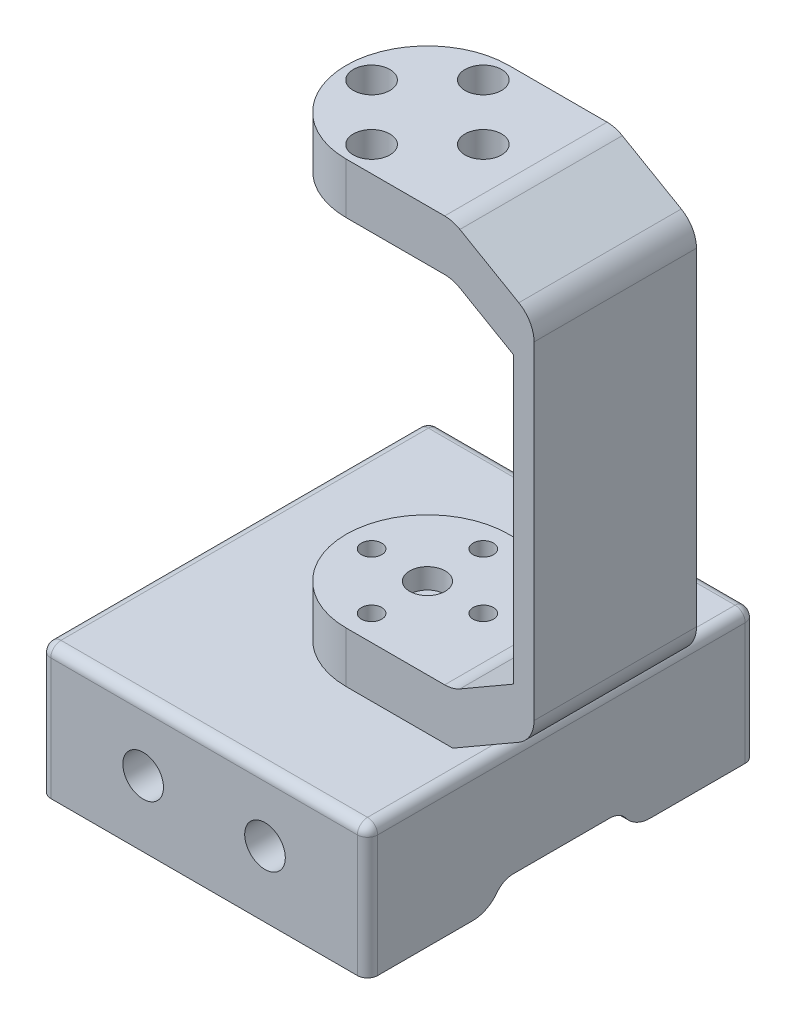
ISO-10303-21;
HEADER;
FILE_DESCRIPTION(('STEP AP214'),'2;1');
FILE_NAME('part.step','',(''),(''),'','','');
FILE_SCHEMA(('AUTOMOTIVE_DESIGN { 1 0 10303 214 1 1 1 1 }'));
ENDSEC;
DATA;
#1=APPLICATION_CONTEXT('core data for automotive mechanical design processes');
#2=APPLICATION_PROTOCOL_DEFINITION('international standard','automotive_design',2000,#1);
#3=PRODUCT_CONTEXT('',#1,'mechanical');
#4=PRODUCT('Part','Part','',(#3));
#5=PRODUCT_RELATED_PRODUCT_CATEGORY('part','',(#4));
#6=PRODUCT_DEFINITION_FORMATION('','',#4);
#7=PRODUCT_DEFINITION_CONTEXT('part definition',#1,'design');
#8=PRODUCT_DEFINITION('design','',#6,#7);
#9=PRODUCT_DEFINITION_SHAPE('','',#8);
#10=(LENGTH_UNIT() NAMED_UNIT(*) SI_UNIT(.MILLI.,.METRE.));
#11=(NAMED_UNIT(*) PLANE_ANGLE_UNIT() SI_UNIT($,.RADIAN.));
#12=(NAMED_UNIT(*) SI_UNIT($,.STERADIAN.) SOLID_ANGLE_UNIT());
#13=UNCERTAINTY_MEASURE_WITH_UNIT(LENGTH_MEASURE(1.E-05),#10,'distance_accuracy_value','');
#14=(GEOMETRIC_REPRESENTATION_CONTEXT(3) GLOBAL_UNCERTAINTY_ASSIGNED_CONTEXT((#13)) GLOBAL_UNIT_ASSIGNED_CONTEXT((#10,
#11,#12)) REPRESENTATION_CONTEXT('',''));
#15=CARTESIAN_POINT('',(0.,0.,0.));
#16=DIRECTION('',(0.,0.,1.));
#17=DIRECTION('',(1.,0.,0.));
#18=AXIS2_PLACEMENT_3D('',#15,#16,#17);
#19=CARTESIAN_POINT('',(-5.50000000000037,26.1345271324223,1.6013303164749E-13));
#20=DIRECTION('',(0.,-1.,0.));
#21=DIRECTION('',(1.,0.,0.));
#22=AXIS2_PLACEMENT_3D('',#19,#20,#21);
#23=CYLINDRICAL_SURFACE('',#22,1.);
#24=CARTESIAN_POINT('',(-5.5000000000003,21.1345271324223,1.29775370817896E-13));
#25=DIRECTION('',(0.,1.,0.));
#26=DIRECTION('',(-1.,0.,0.));
#27=AXIS2_PLACEMENT_3D('',#24,#25,#26);
#28=CIRCLE('',#27,1.);
#29=CARTESIAN_POINT('',(-6.5000000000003,21.1345271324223,1.29775370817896E-13));
#30=VERTEX_POINT('',#29);
#31=EDGE_CURVE('E507',#30,#30,#28,.T.);
#32=ORIENTED_EDGE('',*,*,#31,.F.);
#33=EDGE_LOOP('',(#32));
#34=FACE_BOUND('',#33,.T.);
#35=CARTESIAN_POINT('',(-5.50000000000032,22.6345271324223,1.38882669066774E-13));
#36=DIRECTION('',(0.,1.,0.));
#37=DIRECTION('',(-1.,0.,0.));
#38=AXIS2_PLACEMENT_3D('',#35,#36,#37);
#39=CIRCLE('',#38,1.);
#40=CARTESIAN_POINT('',(-6.50000000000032,22.6345271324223,1.38882669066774E-13));
#41=VERTEX_POINT('',#40);
#42=EDGE_CURVE('E47',#41,#41,#39,.T.);
#43=ORIENTED_EDGE('',*,*,#42,.T.);
#44=EDGE_LOOP('',(#43));
#45=FACE_BOUND('',#44,.T.);
#46=ADVANCED_FACE('F43',(#34,#45),#23,.F.);
#47=CARTESIAN_POINT('',(-3.66148248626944E-13,26.1345271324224,-5.49999999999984));
#48=DIRECTION('',(0.,-1.,0.));
#49=DIRECTION('',(1.,0.,0.));
#50=AXIS2_PLACEMENT_3D('',#47,#48,#49);
#51=CYLINDRICAL_SURFACE('',#50,1.0000000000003);
#52=CARTESIAN_POINT('',(-2.96065420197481E-13,21.1345271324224,-5.49999999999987));
#53=DIRECTION('',(0.,1.,0.));
#54=DIRECTION('',(-1.,0.,0.));
#55=AXIS2_PLACEMENT_3D('',#52,#53,#54);
#56=CIRCLE('',#55,1.0000000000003);
#57=CARTESIAN_POINT('',(-1.0000000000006,21.1345271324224,-5.49999999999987));
#58=VERTEX_POINT('',#57);
#59=EDGE_CURVE('E504',#58,#58,#56,.T.);
#60=ORIENTED_EDGE('',*,*,#59,.F.);
#61=EDGE_LOOP('',(#60));
#62=FACE_BOUND('',#61,.T.);
#63=CARTESIAN_POINT('',(-3.1709026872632E-13,22.6345271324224,-5.49999999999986));
#64=DIRECTION('',(0.,1.,0.));
#65=DIRECTION('',(-1.,0.,0.));
#66=AXIS2_PLACEMENT_3D('',#63,#64,#65);
#67=CIRCLE('',#66,1.0000000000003);
#68=CARTESIAN_POINT('',(-1.00000000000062,22.6345271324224,-5.49999999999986));
#69=VERTEX_POINT('',#68);
#70=EDGE_CURVE('E881',#69,#69,#67,.T.);
#71=ORIENTED_EDGE('',*,*,#70,.T.);
#72=EDGE_LOOP('',(#71));
#73=FACE_BOUND('',#72,.T.);
#74=ADVANCED_FACE('F1003',(#62,#73),#51,.F.);
#75=CARTESIAN_POINT('',(5.49999999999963,26.1345271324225,1.60133031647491E-13));
#76=DIRECTION('',(0.,-1.,0.));
#77=DIRECTION('',(1.,0.,0.));
#78=AXIS2_PLACEMENT_3D('',#75,#76,#77);
#79=CYLINDRICAL_SURFACE('',#78,1.00000000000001);
#80=CARTESIAN_POINT('',(5.4999999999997,21.1345271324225,1.29775370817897E-13));
#81=DIRECTION('',(0.,1.,0.));
#82=DIRECTION('',(-1.,0.,0.));
#83=AXIS2_PLACEMENT_3D('',#80,#81,#82);
#84=CIRCLE('',#83,1.00000000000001);
#85=CARTESIAN_POINT('',(4.4999999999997,21.1345271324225,1.29775370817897E-13));
#86=VERTEX_POINT('',#85);
#87=EDGE_CURVE('E501',#86,#86,#84,.T.);
#88=ORIENTED_EDGE('',*,*,#87,.F.);
#89=EDGE_LOOP('',(#88));
#90=FACE_BOUND('',#89,.T.);
#91=CARTESIAN_POINT('',(5.49999999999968,22.6345271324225,1.38882669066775E-13));
#92=DIRECTION('',(0.,1.,0.));
#93=DIRECTION('',(-1.,0.,0.));
#94=AXIS2_PLACEMENT_3D('',#91,#92,#93);
#95=CIRCLE('',#94,1.00000000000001);
#96=CARTESIAN_POINT('',(4.49999999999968,22.6345271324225,1.38882669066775E-13));
#97=VERTEX_POINT('',#96);
#98=EDGE_CURVE('E879',#97,#97,#95,.T.);
#99=ORIENTED_EDGE('',*,*,#98,.T.);
#100=EDGE_LOOP('',(#99));
#101=FACE_BOUND('',#100,.T.);
#102=ADVANCED_FACE('F1008',(#90,#101),#79,.F.);
#103=CARTESIAN_POINT('',(-3.66148248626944E-13,26.1345271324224,5.50000000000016));
#104=DIRECTION('',(0.,-1.,0.));
#105=DIRECTION('',(1.,0.,0.));
#106=AXIS2_PLACEMENT_3D('',#103,#104,#105);
#107=CYLINDRICAL_SURFACE('',#106,1.);
#108=CARTESIAN_POINT('',(-2.96065420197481E-13,21.1345271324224,5.50000000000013));
#109=DIRECTION('',(0.,1.,0.));
#110=DIRECTION('',(-1.,0.,0.));
#111=AXIS2_PLACEMENT_3D('',#108,#109,#110);
#112=CIRCLE('',#111,1.);
#113=CARTESIAN_POINT('',(-1.0000000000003,21.1345271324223,5.50000000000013));
#114=VERTEX_POINT('',#113);
#115=EDGE_CURVE('E486',#114,#114,#112,.T.);
#116=ORIENTED_EDGE('',*,*,#115,.F.);
#117=EDGE_LOOP('',(#116));
#118=FACE_BOUND('',#117,.T.);
#119=CARTESIAN_POINT('',(-3.1709026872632E-13,22.6345271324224,5.50000000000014));
#120=DIRECTION('',(0.,1.,0.));
#121=DIRECTION('',(-1.,0.,0.));
#122=AXIS2_PLACEMENT_3D('',#119,#120,#121);
#123=CIRCLE('',#122,1.);
#124=CARTESIAN_POINT('',(-1.00000000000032,22.6345271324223,5.50000000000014));
#125=VERTEX_POINT('',#124);
#126=EDGE_CURVE('E383',#125,#125,#123,.T.);
#127=ORIENTED_EDGE('',*,*,#126,.T.);
#128=EDGE_LOOP('',(#127));
#129=FACE_BOUND('',#128,.T.);
#130=ADVANCED_FACE('F1015',(#118,#129),#107,.F.);
#131=CARTESIAN_POINT('',(-5.49999999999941,-41.8654728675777,-2.51192837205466E-13));
#132=DIRECTION('',(0.,1.,0.));
#133=DIRECTION('',(-1.,0.,0.));
#134=AXIS2_PLACEMENT_3D('',#131,#132,#133);
#135=CYLINDRICAL_SURFACE('',#134,1.);
#136=CARTESIAN_POINT('',(-5.49999999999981,-13.8654728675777,0.));
#137=DIRECTION('',(0.,1.,0.));
#138=DIRECTION('',(-1.,0.,0.));
#139=AXIS2_PLACEMENT_3D('',#136,#137,#138);
#140=CIRCLE('',#139,1.);
#141=CARTESIAN_POINT('',(-6.49999999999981,-13.8654728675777,0.));
#142=VERTEX_POINT('',#141);
#143=EDGE_CURVE('E583',#142,#142,#140,.T.);
#144=ORIENTED_EDGE('',*,*,#143,.T.);
#145=EDGE_LOOP('',(#144));
#146=FACE_BOUND('',#145,.T.);
#147=CARTESIAN_POINT('',(-5.49999999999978,-15.3654728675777,0.));
#148=DIRECTION('',(0.,-1.,0.));
#149=DIRECTION('',(1.,0.,0.));
#150=AXIS2_PLACEMENT_3D('',#147,#148,#149);
#151=CIRCLE('',#150,1.);
#152=CARTESIAN_POINT('',(-4.49999999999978,-15.3654728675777,0.));
#153=VERTEX_POINT('',#152);
#154=EDGE_CURVE('E430',#153,#153,#151,.T.);
#155=ORIENTED_EDGE('',*,*,#154,.T.);
#156=EDGE_LOOP('',(#155));
#157=FACE_BOUND('',#156,.T.);
#158=ADVANCED_FACE('F1018',(#146,#157),#135,.F.);
#159=CARTESIAN_POINT('',(5.86116620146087E-13,-41.8654728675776,-5.50000000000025));
#160=DIRECTION('',(0.,1.,0.));
#161=DIRECTION('',(-1.,0.,0.));
#162=AXIS2_PLACEMENT_3D('',#159,#160,#161);
#163=CYLINDRICAL_SURFACE('',#162,1.);
#164=CARTESIAN_POINT('',(1.94167434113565E-13,-13.8654728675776,-5.50000000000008));
#165=DIRECTION('',(0.,1.,0.));
#166=DIRECTION('',(-1.,0.,0.));
#167=AXIS2_PLACEMENT_3D('',#164,#165,#166);
#168=CIRCLE('',#167,1.);
#169=CARTESIAN_POINT('',(-0.999999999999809,-13.8654728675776,-5.50000000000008));
#170=VERTEX_POINT('',#169);
#171=EDGE_CURVE('E580',#170,#170,#168,.T.);
#172=ORIENTED_EDGE('',*,*,#171,.T.);
#173=EDGE_LOOP('',(#172));
#174=FACE_BOUND('',#173,.T.);
#175=CARTESIAN_POINT('',(2.15116620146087E-13,-15.3654728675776,-5.50000000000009));
#176=DIRECTION('',(0.,-1.,0.));
#177=DIRECTION('',(1.,0.,0.));
#178=AXIS2_PLACEMENT_3D('',#175,#176,#177);
#179=CIRCLE('',#178,1.);
#180=CARTESIAN_POINT('',(1.00000000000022,-15.3654728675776,-5.50000000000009));
#181=VERTEX_POINT('',#180);
#182=EDGE_CURVE('E872',#181,#181,#179,.T.);
#183=ORIENTED_EDGE('',*,*,#182,.T.);
#184=EDGE_LOOP('',(#183));
#185=FACE_BOUND('',#184,.T.);
#186=ADVANCED_FACE('F1097',(#174,#185),#163,.F.);
#187=CARTESIAN_POINT('',(5.86116620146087E-13,-41.8654728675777,5.49999999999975));
#188=DIRECTION('',(0.,1.,0.));
#189=DIRECTION('',(-1.,0.,0.));
#190=AXIS2_PLACEMENT_3D('',#187,#188,#189);
#191=CYLINDRICAL_SURFACE('',#190,1.);
#192=CARTESIAN_POINT('',(1.94167434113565E-13,-13.8654728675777,5.49999999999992));
#193=DIRECTION('',(0.,1.,0.));
#194=DIRECTION('',(-1.,0.,0.));
#195=AXIS2_PLACEMENT_3D('',#192,#193,#194);
#196=CIRCLE('',#195,1.);
#197=CARTESIAN_POINT('',(-0.999999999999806,-13.8654728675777,5.49999999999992));
#198=VERTEX_POINT('',#197);
#199=EDGE_CURVE('E574',#198,#198,#196,.T.);
#200=ORIENTED_EDGE('',*,*,#199,.T.);
#201=EDGE_LOOP('',(#200));
#202=FACE_BOUND('',#201,.T.);
#203=CARTESIAN_POINT('',(2.15116620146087E-13,-15.3654728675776,5.4999999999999));
#204=DIRECTION('',(0.,-1.,0.));
#205=DIRECTION('',(1.,0.,0.));
#206=AXIS2_PLACEMENT_3D('',#203,#204,#205);
#207=CIRCLE('',#206,1.);
#208=CARTESIAN_POINT('',(1.00000000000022,-15.3654728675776,5.4999999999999));
#209=VERTEX_POINT('',#208);
#210=EDGE_CURVE('E869',#209,#209,#207,.T.);
#211=ORIENTED_EDGE('',*,*,#210,.T.);
#212=EDGE_LOOP('',(#211));
#213=FACE_BOUND('',#212,.T.);
#214=ADVANCED_FACE('F1093',(#202,#213),#191,.F.);
#215=CARTESIAN_POINT('',(5.50000000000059,-41.8654728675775,-2.51192837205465E-13));
#216=DIRECTION('',(0.,1.,0.));
#217=DIRECTION('',(-1.,0.,0.));
#218=AXIS2_PLACEMENT_3D('',#215,#216,#217);
#219=CYLINDRICAL_SURFACE('',#218,1.00000000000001);
#220=CARTESIAN_POINT('',(5.50000000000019,-13.8654728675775,0.));
#221=DIRECTION('',(0.,1.,0.));
#222=DIRECTION('',(-1.,0.,0.));
#223=AXIS2_PLACEMENT_3D('',#220,#221,#222);
#224=CIRCLE('',#223,1.);
#225=CARTESIAN_POINT('',(4.50000000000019,-13.8654728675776,0.));
#226=VERTEX_POINT('',#225);
#227=EDGE_CURVE('E577',#226,#226,#224,.T.);
#228=ORIENTED_EDGE('',*,*,#227,.T.);
#229=EDGE_LOOP('',(#228));
#230=FACE_BOUND('',#229,.T.);
#231=CARTESIAN_POINT('',(5.50000000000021,-15.3654728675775,0.));
#232=DIRECTION('',(0.,-1.,0.));
#233=DIRECTION('',(1.,0.,0.));
#234=AXIS2_PLACEMENT_3D('',#231,#232,#233);
#235=CIRCLE('',#234,1.00000000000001);
#236=CARTESIAN_POINT('',(6.50000000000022,-15.3654728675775,0.));
#237=VERTEX_POINT('',#236);
#238=EDGE_CURVE('E407',#237,#237,#235,.T.);
#239=ORIENTED_EDGE('',*,*,#238,.T.);
#240=EDGE_LOOP('',(#239));
#241=FACE_BOUND('',#240,.T.);
#242=ADVANCED_FACE('F1063',(#230,#241),#219,.F.);
#243=CARTESIAN_POINT('',(-8.89999999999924,-25.3654728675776,21.4999999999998));
#244=DIRECTION('',(0.,0.,-1.));
#245=DIRECTION('',(0.,1.,0.));
#246=AXIS2_PLACEMENT_3D('',#243,#244,#245);
#247=CYLINDRICAL_SURFACE('',#246,1.);
#248=CARTESIAN_POINT('',(-8.89999999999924,-25.3654728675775,14.0999999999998));
#249=DIRECTION('',(0.,0.,-1.));
#250=DIRECTION('',(0.,1.,0.));
#251=AXIS2_PLACEMENT_3D('',#248,#249,#250);
#252=CIRCLE('',#251,1.);
#253=CARTESIAN_POINT('',(-8.89999999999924,-24.3654728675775,14.0999999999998));
#254=VERTEX_POINT('',#253);
#255=EDGE_CURVE('E601',#254,#254,#252,.T.);
#256=ORIENTED_EDGE('',*,*,#255,.T.);
#257=EDGE_LOOP('',(#256));
#258=FACE_BOUND('',#257,.T.);
#259=CARTESIAN_POINT('',(-8.89999999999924,-25.3654728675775,15.6));
#260=DIRECTION('',(0.,0.,1.));
#261=DIRECTION('',(1.,0.,0.));
#262=AXIS2_PLACEMENT_3D('',#259,#260,#261);
#263=CIRCLE('',#262,1.);
#264=CARTESIAN_POINT('',(-7.89999999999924,-25.3654728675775,15.6));
#265=VERTEX_POINT('',#264);
#266=EDGE_CURVE('E448',#265,#265,#263,.F.);
#267=ORIENTED_EDGE('',*,*,#266,.F.);
#268=EDGE_LOOP('',(#267));
#269=FACE_BOUND('',#268,.T.);
#270=ADVANCED_FACE('F1059',(#258,#269),#247,.F.);
#271=CARTESIAN_POINT('',(3.10000000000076,-25.3654728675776,21.4999999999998));
#272=DIRECTION('',(0.,0.,-1.));
#273=DIRECTION('',(0.,1.,0.));
#274=AXIS2_PLACEMENT_3D('',#271,#272,#273);
#275=CYLINDRICAL_SURFACE('',#274,1.);
#276=CARTESIAN_POINT('',(3.10000000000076,-25.3654728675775,14.0999999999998));
#277=DIRECTION('',(0.,0.,-1.));
#278=DIRECTION('',(0.,1.,0.));
#279=AXIS2_PLACEMENT_3D('',#276,#277,#278);
#280=CIRCLE('',#279,1.);
#281=CARTESIAN_POINT('',(3.10000000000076,-24.3654728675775,14.0999999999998));
#282=VERTEX_POINT('',#281);
#283=EDGE_CURVE('E604',#282,#282,#280,.T.);
#284=ORIENTED_EDGE('',*,*,#283,.T.);
#285=EDGE_LOOP('',(#284));
#286=FACE_BOUND('',#285,.T.);
#287=CARTESIAN_POINT('',(3.10000000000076,-25.3654728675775,15.6));
#288=DIRECTION('',(0.,0.,1.));
#289=DIRECTION('',(1.,0.,0.));
#290=AXIS2_PLACEMENT_3D('',#287,#288,#289);
#291=CIRCLE('',#290,1.);
#292=CARTESIAN_POINT('',(4.10000000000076,-25.3654728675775,15.6));
#293=VERTEX_POINT('',#292);
#294=EDGE_CURVE('E434',#293,#293,#291,.F.);
#295=ORIENTED_EDGE('',*,*,#294,.F.);
#296=EDGE_LOOP('',(#295));
#297=FACE_BOUND('',#296,.T.);
#298=ADVANCED_FACE('F1055',(#286,#297),#275,.F.);
#299=CARTESIAN_POINT('',(-18.9999999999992,-54.865472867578,19.0999999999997));
#300=DIRECTION('',(0.,0.,1.));
#301=DIRECTION('',(0.,-1.,0.));
#302=AXIS2_PLACEMENT_3D('',#299,#300,#301);
#303=PLANE('',#302);
#304=CARTESIAN_POINT('',(-8.89999999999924,-25.3654728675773,19.1));
#305=DIRECTION('',(0.,0.,1.));
#306=DIRECTION('',(1.,0.,0.));
#307=AXIS2_PLACEMENT_3D('',#304,#305,#306);
#308=CIRCLE('',#307,2.);
#309=CARTESIAN_POINT('',(-6.89999999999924,-25.3654728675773,19.1));
#310=VERTEX_POINT('',#309);
#311=EDGE_CURVE('E435',#310,#310,#308,.T.);
#312=ORIENTED_EDGE('',*,*,#311,.F.);
#313=EDGE_LOOP('',(#312));
#314=FACE_BOUND('',#313,.T.);
#315=CARTESIAN_POINT('',(3.10000000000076,-25.3654728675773,19.1));
#316=DIRECTION('',(0.,0.,1.));
#317=DIRECTION('',(1.,0.,0.));
#318=AXIS2_PLACEMENT_3D('',#315,#316,#317);
#319=CIRCLE('',#318,2.);
#320=CARTESIAN_POINT('',(5.10000000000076,-25.3654728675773,19.1));
#321=VERTEX_POINT('',#320);
#322=EDGE_CURVE('E441',#321,#321,#319,.T.);
#323=ORIENTED_EDGE('',*,*,#322,.F.);
#324=EDGE_LOOP('',(#323));
#325=FACE_BOUND('',#324,.T.);
#326=DIRECTION('',(0.,1.,0.));
#327=VECTOR('',#326,1.);
#328=CARTESIAN_POINT('',(-17.9999999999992,-54.865472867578,19.0999999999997));
#329=LINE('',#328,#327);
#330=CARTESIAN_POINT('',(-17.9999999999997,-19.865472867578,19.0999999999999));
#331=VERTEX_POINT('',#330);
#332=CARTESIAN_POINT('',(-17.9999999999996,-31.8654728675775,19.0999999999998));
#333=VERTEX_POINT('',#332);
#334=EDGE_CURVE('E718',#331,#333,#329,.F.);
#335=ORIENTED_EDGE('',*,*,#334,.T.);
#336=DIRECTION('',(1.,0.,0.));
#337=VECTOR('',#336,1.);
#338=CARTESIAN_POINT('',(-18.9999999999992,-31.8654728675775,19.0999999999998));
#339=LINE('',#338,#337);
#340=CARTESIAN_POINT('',(12.2000000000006,-31.8654728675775,19.0999999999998));
#341=VERTEX_POINT('',#340);
#342=EDGE_CURVE('E447',#333,#341,#339,.T.);
#343=ORIENTED_EDGE('',*,*,#342,.T.);
#344=DIRECTION('',(0.,1.,0.));
#345=VECTOR('',#344,1.);
#346=CARTESIAN_POINT('',(12.2000000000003,-19.8654728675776,19.0999999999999));
#347=LINE('',#346,#345);
#348=CARTESIAN_POINT('',(12.2000000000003,-19.8654728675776,19.0999999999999));
#349=VERTEX_POINT('',#348);
#350=EDGE_CURVE('E721',#341,#349,#347,.T.);
#351=ORIENTED_EDGE('',*,*,#350,.T.);
#352=DIRECTION('',(1.,0.,0.));
#353=VECTOR('',#352,1.);
#354=CARTESIAN_POINT('',(-18.9999999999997,-19.865472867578,19.0999999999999));
#355=LINE('',#354,#353);
#356=EDGE_CURVE('E662',#349,#331,#355,.F.);
#357=ORIENTED_EDGE('',*,*,#356,.T.);
#358=EDGE_LOOP('',(#335,#343,#351,#357));
#359=FACE_BOUND('',#358,.T.);
#360=ADVANCED_FACE('F1058',(#314,#325,#359),#303,.T.);
#361=CARTESIAN_POINT('',(2.99250262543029E-13,-21.3654728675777,14.0999999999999));
#362=DIRECTION('',(0.,0.,-1.));
#363=DIRECTION('',(0.,1.,0.));
#364=AXIS2_PLACEMENT_3D('',#361,#362,#363);
#365=PLANE('',#364);
#366=ORIENTED_EDGE('',*,*,#255,.F.);
#367=EDGE_LOOP('',(#366));
#368=FACE_BOUND('',#367,.T.);
#369=ORIENTED_EDGE('',*,*,#283,.F.);
#370=EDGE_LOOP('',(#369));
#371=FACE_BOUND('',#370,.T.);
#372=DIRECTION('',(0.,-1.,0.));
#373=VECTOR('',#372,1.);
#374=CARTESIAN_POINT('',(8.20000000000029,-21.3654728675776,14.0999999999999));
#375=LINE('',#374,#373);
#376=CARTESIAN_POINT('',(8.20000000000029,-21.3654728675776,14.0999999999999));
#377=VERTEX_POINT('',#376);
#378=CARTESIAN_POINT('',(8.20000000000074,-31.8654728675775,14.0999999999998));
#379=VERTEX_POINT('',#378);
#380=EDGE_CURVE('E640',#377,#379,#375,.T.);
#381=ORIENTED_EDGE('',*,*,#380,.T.);
#382=DIRECTION('',(-1.,0.,0.));
#383=VECTOR('',#382,1.);
#384=CARTESIAN_POINT('',(2.99250262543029E-13,-31.8654728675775,14.0999999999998));
#385=LINE('',#384,#383);
#386=CARTESIAN_POINT('',(-13.9999999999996,-31.8654728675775,14.0999999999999));
#387=VERTEX_POINT('',#386);
#388=EDGE_CURVE('E475',#379,#387,#385,.T.);
#389=ORIENTED_EDGE('',*,*,#388,.T.);
#390=DIRECTION('',(0.,-1.,0.));
#391=VECTOR('',#390,1.);
#392=CARTESIAN_POINT('',(-13.9999999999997,-21.3654728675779,14.0999999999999));
#393=LINE('',#392,#391);
#394=CARTESIAN_POINT('',(-13.9999999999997,-21.3654728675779,14.0999999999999));
#395=VERTEX_POINT('',#394);
#396=EDGE_CURVE('E631',#395,#387,#393,.T.);
#397=ORIENTED_EDGE('',*,*,#396,.F.);
#398=DIRECTION('',(1.,0.,0.));
#399=VECTOR('',#398,1.);
#400=CARTESIAN_POINT('',(2.99250262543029E-13,-21.3654728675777,14.0999999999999));
#401=LINE('',#400,#399);
#402=EDGE_CURVE('E611',#395,#377,#401,.T.);
#403=ORIENTED_EDGE('',*,*,#402,.T.);
#404=EDGE_LOOP('',(#381,#389,#397,#403));
#405=FACE_BOUND('',#404,.T.);
#406=ADVANCED_FACE('F1122',(#368,#371,#405),#365,.T.);
#407=CARTESIAN_POINT('',(-18.9999999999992,-54.8654728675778,-19.1000000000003));
#408=DIRECTION('',(-1.,0.,0.));
#409=DIRECTION('',(0.,-1.,0.));
#410=AXIS2_PLACEMENT_3D('',#407,#408,#409);
#411=PLANE('',#410);
#412=DIRECTION('',(0.,0.,1.));
#413=VECTOR('',#412,1.);
#414=CARTESIAN_POINT('',(-18.9999999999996,-31.8654728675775,-19.1000000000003));
#415=LINE('',#414,#413);
#416=CARTESIAN_POINT('',(-18.9999999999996,-31.8654728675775,-18.1000000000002));
#417=VERTEX_POINT('',#416);
#418=CARTESIAN_POINT('',(-18.9999999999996,-31.8654728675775,-8.75000000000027));
#419=VERTEX_POINT('',#418);
#420=EDGE_CURVE('E449',#417,#419,#415,.T.);
#421=ORIENTED_EDGE('',*,*,#420,.T.);
#422=CARTESIAN_POINT('',(-18.9999999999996,-28.8654728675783,-8.75000000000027));
#423=DIRECTION('',(-1.,0.,0.));
#424=DIRECTION('',(0.,-1.,0.));
#425=AXIS2_PLACEMENT_3D('',#422,#423,#424);
#426=CIRCLE('',#425,3.);
#427=CARTESIAN_POINT('',(-18.9999999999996,-30.6654728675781,-6.35000000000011));
#428=VERTEX_POINT('',#427);
#429=EDGE_CURVE('E779',#419,#428,#426,.T.);
#430=ORIENTED_EDGE('',*,*,#429,.T.);
#431=CARTESIAN_POINT('',(-18.9999999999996,-31.865472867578,-4.75));
#432=DIRECTION('',(-1.,0.,0.));
#433=DIRECTION('',(0.,-1.,0.));
#434=AXIS2_PLACEMENT_3D('',#431,#432,#433);
#435=CIRCLE('',#434,2.);
#436=CARTESIAN_POINT('',(-18.9999999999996,-29.865472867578,-4.75));
#437=VERTEX_POINT('',#436);
#438=EDGE_CURVE('E678',#428,#437,#435,.F.);
#439=ORIENTED_EDGE('',*,*,#438,.T.);
#440=DIRECTION('',(0.,0.,-1.));
#441=VECTOR('',#440,1.);
#442=CARTESIAN_POINT('',(-18.9999999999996,-29.865472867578,6.75));
#443=LINE('',#442,#441);
#444=CARTESIAN_POINT('',(-18.9999999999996,-29.865472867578,4.75));
#445=VERTEX_POINT('',#444);
#446=EDGE_CURVE('E590',#445,#437,#443,.T.);
#447=ORIENTED_EDGE('',*,*,#446,.F.);
#448=CARTESIAN_POINT('',(-18.9999999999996,-31.865472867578,4.75));
#449=DIRECTION('',(-1.,0.,0.));
#450=DIRECTION('',(0.,-1.,0.));
#451=AXIS2_PLACEMENT_3D('',#448,#449,#450);
#452=CIRCLE('',#451,2.);
#453=CARTESIAN_POINT('',(-18.9999999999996,-30.6654728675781,6.3500000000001));
#454=VERTEX_POINT('',#453);
#455=EDGE_CURVE('E683',#445,#454,#452,.F.);
#456=ORIENTED_EDGE('',*,*,#455,.T.);
#457=CARTESIAN_POINT('',(-18.9999999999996,-28.8654728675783,8.75000000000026));
#458=DIRECTION('',(-1.,0.,0.));
#459=DIRECTION('',(0.,-1.,0.));
#460=AXIS2_PLACEMENT_3D('',#457,#458,#459);
#461=CIRCLE('',#460,3.);
#462=CARTESIAN_POINT('',(-18.9999999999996,-31.8654728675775,8.75000000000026));
#463=VERTEX_POINT('',#462);
#464=EDGE_CURVE('E777',#454,#463,#461,.T.);
#465=ORIENTED_EDGE('',*,*,#464,.T.);
#466=CARTESIAN_POINT('',(-18.9999999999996,-31.8654728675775,18.0999999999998));
#467=VERTEX_POINT('',#466);
#468=EDGE_CURVE('E445',#463,#467,#415,.T.);
#469=ORIENTED_EDGE('',*,*,#468,.T.);
#470=DIRECTION('',(0.,1.,0.));
#471=VECTOR('',#470,1.);
#472=CARTESIAN_POINT('',(-18.9999999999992,-54.865472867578,18.0999999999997));
#473=LINE('',#472,#471);
#474=CARTESIAN_POINT('',(-18.9999999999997,-19.865472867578,18.0999999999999));
#475=VERTEX_POINT('',#474);
#476=EDGE_CURVE('E716',#467,#475,#473,.T.);
#477=ORIENTED_EDGE('',*,*,#476,.T.);
#478=DIRECTION('',(0.,0.,1.));
#479=VECTOR('',#478,1.);
#480=CARTESIAN_POINT('',(-18.9999999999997,-19.8654728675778,-19.1000000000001));
#481=LINE('',#480,#479);
#482=CARTESIAN_POINT('',(-18.9999999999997,-19.8654728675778,-18.1000000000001));
#483=VERTEX_POINT('',#482);
#484=EDGE_CURVE('E659',#475,#483,#481,.F.);
#485=ORIENTED_EDGE('',*,*,#484,.T.);
#486=DIRECTION('',(0.,1.,0.));
#487=VECTOR('',#486,1.);
#488=CARTESIAN_POINT('',(-18.9999999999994,-44.8654728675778,-18.1000000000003));
#489=LINE('',#488,#487);
#490=EDGE_CURVE('E713',#483,#417,#489,.F.);
#491=ORIENTED_EDGE('',*,*,#490,.T.);
#492=EDGE_LOOP('',(#421,#430,#439,#447,#456,#465,#469,#477,#485,#491));
#493=FACE_BOUND('',#492,.T.);
#494=ADVANCED_FACE('F1125',(#493),#411,.T.);
#495=CARTESIAN_POINT('',(-18.9999999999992,-54.8654728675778,-19.1000000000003));
#496=DIRECTION('',(0.,0.,1.));
#497=DIRECTION('',(0.,-1.,0.));
#498=AXIS2_PLACEMENT_3D('',#495,#496,#497);
#499=PLANE('',#498);
#500=CARTESIAN_POINT('',(-8.89999999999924,-25.3654728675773,-19.1000000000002));
#501=DIRECTION('',(0.,0.,1.));
#502=DIRECTION('',(0.,-1.,0.));
#503=AXIS2_PLACEMENT_3D('',#500,#501,#502);
#504=CIRCLE('',#503,2.);
#505=CARTESIAN_POINT('',(-8.89999999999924,-27.3654728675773,-19.1000000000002));
#506=VERTEX_POINT('',#505);
#507=EDGE_CURVE('E421',#506,#506,#504,.T.);
#508=ORIENTED_EDGE('',*,*,#507,.T.);
#509=EDGE_LOOP('',(#508));
#510=FACE_BOUND('',#509,.T.);
#511=CARTESIAN_POINT('',(3.10000000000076,-25.3654728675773,-19.1000000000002));
#512=DIRECTION('',(0.,0.,1.));
#513=DIRECTION('',(0.,-1.,0.));
#514=AXIS2_PLACEMENT_3D('',#511,#512,#513);
#515=CIRCLE('',#514,2.);
#516=CARTESIAN_POINT('',(3.10000000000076,-27.3654728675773,-19.1000000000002));
#517=VERTEX_POINT('',#516);
#518=EDGE_CURVE('E427',#517,#517,#515,.T.);
#519=ORIENTED_EDGE('',*,*,#518,.T.);
#520=EDGE_LOOP('',(#519));
#521=FACE_BOUND('',#520,.T.);
#522=DIRECTION('',(1.,0.,0.));
#523=VECTOR('',#522,1.);
#524=CARTESIAN_POINT('',(-18.9999999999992,-31.8654728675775,-19.1000000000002));
#525=LINE('',#524,#523);
#526=CARTESIAN_POINT('',(-17.9999999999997,-31.8654728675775,-19.1000000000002));
#527=VERTEX_POINT('',#526);
#528=CARTESIAN_POINT('',(12.2000000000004,-31.8654728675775,-19.1000000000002));
#529=VERTEX_POINT('',#528);
#530=EDGE_CURVE('E461',#527,#529,#525,.T.);
#531=ORIENTED_EDGE('',*,*,#530,.F.);
#532=DIRECTION('',(0.,1.,0.));
#533=VECTOR('',#532,1.);
#534=CARTESIAN_POINT('',(-17.9999999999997,-19.8654728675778,-19.1000000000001));
#535=LINE('',#534,#533);
#536=CARTESIAN_POINT('',(-17.9999999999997,-19.8654728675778,-19.1000000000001));
#537=VERTEX_POINT('',#536);
#538=EDGE_CURVE('E736',#527,#537,#535,.T.);
#539=ORIENTED_EDGE('',*,*,#538,.T.);
#540=DIRECTION('',(1.,0.,0.));
#541=VECTOR('',#540,1.);
#542=CARTESIAN_POINT('',(13.2000000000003,-19.8654728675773,-19.1000000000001));
#543=LINE('',#542,#541);
#544=CARTESIAN_POINT('',(12.2000000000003,-19.8654728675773,-19.1000000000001));
#545=VERTEX_POINT('',#544);
#546=EDGE_CURVE('E643',#537,#545,#543,.T.);
#547=ORIENTED_EDGE('',*,*,#546,.T.);
#548=DIRECTION('',(0.,1.,0.));
#549=VECTOR('',#548,1.);
#550=CARTESIAN_POINT('',(12.2000000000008,-54.8654728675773,-19.1000000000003));
#551=LINE('',#550,#549);
#552=EDGE_CURVE('E738',#545,#529,#551,.F.);
#553=ORIENTED_EDGE('',*,*,#552,.T.);
#554=EDGE_LOOP('',(#531,#539,#547,#553));
#555=FACE_BOUND('',#554,.T.);
#556=ADVANCED_FACE('F1129',(#510,#521,#555),#499,.F.);
#557=CARTESIAN_POINT('',(13.2000000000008,-54.8654728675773,-19.1000000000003));
#558=DIRECTION('',(-1.,0.,0.));
#559=DIRECTION('',(0.,-1.,0.));
#560=AXIS2_PLACEMENT_3D('',#557,#558,#559);
#561=PLANE('',#560);
#562=CARTESIAN_POINT('',(13.2000000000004,-31.8654728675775,-4.75));
#563=DIRECTION('',(-1.,0.,0.));
#564=DIRECTION('',(0.,-1.,0.));
#565=AXIS2_PLACEMENT_3D('',#562,#563,#564);
#566=CIRCLE('',#565,2.);
#567=CARTESIAN_POINT('',(13.2000000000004,-29.8654728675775,-4.75));
#568=VERTEX_POINT('',#567);
#569=CARTESIAN_POINT('',(13.2000000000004,-30.6654728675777,-6.35000000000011));
#570=VERTEX_POINT('',#569);
#571=EDGE_CURVE('E695',#568,#570,#566,.T.);
#572=ORIENTED_EDGE('',*,*,#571,.T.);
#573=CARTESIAN_POINT('',(13.2000000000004,-28.8654728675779,-8.75000000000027));
#574=DIRECTION('',(-1.,0.,0.));
#575=DIRECTION('',(0.,-1.,0.));
#576=AXIS2_PLACEMENT_3D('',#573,#574,#575);
#577=CIRCLE('',#576,3.);
#578=CARTESIAN_POINT('',(13.2000000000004,-31.8654728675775,-8.75000000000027));
#579=VERTEX_POINT('',#578);
#580=EDGE_CURVE('E775',#570,#579,#577,.F.);
#581=ORIENTED_EDGE('',*,*,#580,.T.);
#582=DIRECTION('',(0.,0.,1.));
#583=VECTOR('',#582,1.);
#584=CARTESIAN_POINT('',(13.2000000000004,-31.8654728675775,-19.1000000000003));
#585=LINE('',#584,#583);
#586=CARTESIAN_POINT('',(13.2000000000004,-31.8654728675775,-18.1000000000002));
#587=VERTEX_POINT('',#586);
#588=EDGE_CURVE('E458',#587,#579,#585,.T.);
#589=ORIENTED_EDGE('',*,*,#588,.F.);
#590=DIRECTION('',(0.,1.,0.));
#591=VECTOR('',#590,1.);
#592=CARTESIAN_POINT('',(13.2000000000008,-54.8654728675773,-18.1000000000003));
#593=LINE('',#592,#591);
#594=CARTESIAN_POINT('',(13.2000000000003,-19.8654728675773,-18.1000000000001));
#595=VERTEX_POINT('',#594);
#596=EDGE_CURVE('E723',#587,#595,#593,.T.);
#597=ORIENTED_EDGE('',*,*,#596,.T.);
#598=DIRECTION('',(0.,0.,1.));
#599=VECTOR('',#598,1.);
#600=CARTESIAN_POINT('',(13.2000000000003,-19.8654728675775,18.0999999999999));
#601=LINE('',#600,#599);
#602=CARTESIAN_POINT('',(13.2000000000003,-19.8654728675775,18.0999999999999));
#603=VERTEX_POINT('',#602);
#604=EDGE_CURVE('E725',#595,#603,#601,.T.);
#605=ORIENTED_EDGE('',*,*,#604,.T.);
#606=DIRECTION('',(0.,1.,0.));
#607=VECTOR('',#606,1.);
#608=CARTESIAN_POINT('',(13.2000000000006,-44.8654728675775,18.0999999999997));
#609=LINE('',#608,#607);
#610=CARTESIAN_POINT('',(13.2000000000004,-31.8654728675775,18.0999999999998));
#611=VERTEX_POINT('',#610);
#612=EDGE_CURVE('E727',#603,#611,#609,.F.);
#613=ORIENTED_EDGE('',*,*,#612,.T.);
#614=CARTESIAN_POINT('',(13.2000000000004,-31.8654728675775,8.75000000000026));
#615=VERTEX_POINT('',#614);
#616=EDGE_CURVE('E455',#615,#611,#585,.T.);
#617=ORIENTED_EDGE('',*,*,#616,.F.);
#618=CARTESIAN_POINT('',(13.2000000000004,-28.8654728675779,8.75000000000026));
#619=DIRECTION('',(-1.,0.,0.));
#620=DIRECTION('',(0.,-1.,0.));
#621=AXIS2_PLACEMENT_3D('',#618,#619,#620);
#622=CIRCLE('',#621,3.);
#623=CARTESIAN_POINT('',(13.2000000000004,-30.6654728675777,6.3500000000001));
#624=VERTEX_POINT('',#623);
#625=EDGE_CURVE('E773',#615,#624,#622,.F.);
#626=ORIENTED_EDGE('',*,*,#625,.T.);
#627=CARTESIAN_POINT('',(13.2000000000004,-31.8654728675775,4.75));
#628=DIRECTION('',(-1.,0.,0.));
#629=DIRECTION('',(0.,-1.,0.));
#630=AXIS2_PLACEMENT_3D('',#627,#628,#629);
#631=CIRCLE('',#630,2.);
#632=CARTESIAN_POINT('',(13.2000000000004,-29.8654728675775,4.75));
#633=VERTEX_POINT('',#632);
#634=EDGE_CURVE('E691',#624,#633,#631,.T.);
#635=ORIENTED_EDGE('',*,*,#634,.T.);
#636=DIRECTION('',(0.,0.,-1.));
#637=VECTOR('',#636,1.);
#638=CARTESIAN_POINT('',(13.2000000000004,-29.8654728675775,-19.1000000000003));
#639=LINE('',#638,#637);
#640=EDGE_CURVE('E598',#633,#568,#639,.T.);
#641=ORIENTED_EDGE('',*,*,#640,.T.);
#642=EDGE_LOOP('',(#572,#581,#589,#597,#605,#613,#617,#626,#635,#641));
#643=FACE_BOUND('',#642,.T.);
#644=ADVANCED_FACE('F1120',(#643),#561,.F.);
#645=CARTESIAN_POINT('',(8.20000000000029,-21.3654728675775,-1.28085915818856E-13));
#646=DIRECTION('',(1.,0.,0.));
#647=DIRECTION('',(0.,1.,0.));
#648=AXIS2_PLACEMENT_3D('',#645,#646,#647);
#649=PLANE('',#648);
#650=DIRECTION('',(0.,0.,-1.));
#651=VECTOR('',#650,1.);
#652=CARTESIAN_POINT('',(8.20000000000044,-31.8654728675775,-1.28085915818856E-13));
#653=LINE('',#652,#651);
#654=CARTESIAN_POINT('',(8.20000000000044,-31.8654728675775,-8.75000000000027));
#655=VERTEX_POINT('',#654);
#656=CARTESIAN_POINT('',(8.20000000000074,-31.8654728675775,-14.1000000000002));
#657=VERTEX_POINT('',#656);
#658=EDGE_CURVE('E472',#655,#657,#653,.T.);
#659=ORIENTED_EDGE('',*,*,#658,.F.);
#660=CARTESIAN_POINT('',(8.20000000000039,-28.8654728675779,-8.75000000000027));
#661=DIRECTION('',(1.,0.,0.));
#662=DIRECTION('',(0.,1.,0.));
#663=AXIS2_PLACEMENT_3D('',#660,#661,#662);
#664=CIRCLE('',#663,3.);
#665=CARTESIAN_POINT('',(8.20000000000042,-30.6654728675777,-6.35000000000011));
#666=VERTEX_POINT('',#665);
#667=EDGE_CURVE('E769',#655,#666,#664,.F.);
#668=ORIENTED_EDGE('',*,*,#667,.T.);
#669=CARTESIAN_POINT('',(8.20000000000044,-31.8654728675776,-4.75));
#670=DIRECTION('',(1.,0.,0.));
#671=DIRECTION('',(0.,1.,0.));
#672=AXIS2_PLACEMENT_3D('',#669,#670,#671);
#673=CIRCLE('',#672,2.);
#674=CARTESIAN_POINT('',(8.20000000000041,-29.8654728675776,-4.75));
#675=VERTEX_POINT('',#674);
#676=EDGE_CURVE('E693',#666,#675,#673,.T.);
#677=ORIENTED_EDGE('',*,*,#676,.T.);
#678=DIRECTION('',(0.,0.,1.));
#679=VECTOR('',#678,1.);
#680=CARTESIAN_POINT('',(8.20000000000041,-29.8654728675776,-1.28085915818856E-13));
#681=LINE('',#680,#679);
#682=CARTESIAN_POINT('',(8.20000000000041,-29.8654728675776,4.75));
#683=VERTEX_POINT('',#682);
#684=EDGE_CURVE('E595',#675,#683,#681,.T.);
#685=ORIENTED_EDGE('',*,*,#684,.T.);
#686=CARTESIAN_POINT('',(8.20000000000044,-31.8654728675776,4.75));
#687=DIRECTION('',(1.,0.,0.));
#688=DIRECTION('',(0.,1.,0.));
#689=AXIS2_PLACEMENT_3D('',#686,#687,#688);
#690=CIRCLE('',#689,2.);
#691=CARTESIAN_POINT('',(8.20000000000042,-30.6654728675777,6.3500000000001));
#692=VERTEX_POINT('',#691);
#693=EDGE_CURVE('E688',#683,#692,#690,.T.);
#694=ORIENTED_EDGE('',*,*,#693,.T.);
#695=CARTESIAN_POINT('',(8.20000000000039,-28.8654728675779,8.75000000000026));
#696=DIRECTION('',(1.,0.,0.));
#697=DIRECTION('',(0.,1.,0.));
#698=AXIS2_PLACEMENT_3D('',#695,#696,#697);
#699=CIRCLE('',#698,3.);
#700=CARTESIAN_POINT('',(8.20000000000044,-31.8654728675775,8.75000000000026));
#701=VERTEX_POINT('',#700);
#702=EDGE_CURVE('E767',#692,#701,#699,.F.);
#703=ORIENTED_EDGE('',*,*,#702,.T.);
#704=EDGE_CURVE('E474',#379,#701,#653,.T.);
#705=ORIENTED_EDGE('',*,*,#704,.F.);
#706=ORIENTED_EDGE('',*,*,#380,.F.);
#707=DIRECTION('',(0.,0.,1.));
#708=VECTOR('',#707,1.);
#709=CARTESIAN_POINT('',(8.20000000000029,-21.3654728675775,-1.28085915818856E-13));
#710=LINE('',#709,#708);
#711=CARTESIAN_POINT('',(8.20000000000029,-21.3654728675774,-14.1000000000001));
#712=VERTEX_POINT('',#711);
#713=EDGE_CURVE('E623',#712,#377,#710,.T.);
#714=ORIENTED_EDGE('',*,*,#713,.F.);
#715=DIRECTION('',(0.,-1.,0.));
#716=VECTOR('',#715,1.);
#717=CARTESIAN_POINT('',(8.20000000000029,-21.3654728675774,-14.1000000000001));
#718=LINE('',#717,#716);
#719=EDGE_CURVE('E637',#712,#657,#718,.T.);
#720=ORIENTED_EDGE('',*,*,#719,.T.);
#721=EDGE_LOOP('',(#659,#668,#677,#685,#694,#703,#705,#706,#714,#720));
#722=FACE_BOUND('',#721,.T.);
#723=ADVANCED_FACE('F1116',(#722),#649,.F.);
#724=CARTESIAN_POINT('',(2.99250262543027E-13,-21.3654728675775,-14.1000000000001));
#725=DIRECTION('',(0.,0.,-1.));
#726=DIRECTION('',(0.,1.,0.));
#727=AXIS2_PLACEMENT_3D('',#724,#725,#726);
#728=PLANE('',#727);
#729=CARTESIAN_POINT('',(-8.89999999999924,-25.3654728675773,-14.1000000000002));
#730=DIRECTION('',(0.,0.,-1.));
#731=DIRECTION('',(0.,1.,0.));
#732=AXIS2_PLACEMENT_3D('',#729,#730,#731);
#733=CIRCLE('',#732,1.);
#734=CARTESIAN_POINT('',(-8.89999999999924,-24.3654728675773,-14.1000000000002));
#735=VERTEX_POINT('',#734);
#736=EDGE_CURVE('E607',#735,#735,#733,.T.);
#737=ORIENTED_EDGE('',*,*,#736,.T.);
#738=EDGE_LOOP('',(#737));
#739=FACE_BOUND('',#738,.T.);
#740=CARTESIAN_POINT('',(3.10000000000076,-25.3654728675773,-14.1000000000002));
#741=DIRECTION('',(0.,0.,-1.));
#742=DIRECTION('',(0.,1.,0.));
#743=AXIS2_PLACEMENT_3D('',#740,#741,#742);
#744=CIRCLE('',#743,1.);
#745=CARTESIAN_POINT('',(3.10000000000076,-24.3654728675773,-14.1000000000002));
#746=VERTEX_POINT('',#745);
#747=EDGE_CURVE('E621',#746,#746,#744,.T.);
#748=ORIENTED_EDGE('',*,*,#747,.T.);
#749=EDGE_LOOP('',(#748));
#750=FACE_BOUND('',#749,.T.);
#751=DIRECTION('',(-1.,0.,0.));
#752=VECTOR('',#751,1.);
#753=CARTESIAN_POINT('',(2.99250262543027E-13,-31.8654728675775,-14.1000000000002));
#754=LINE('',#753,#752);
#755=CARTESIAN_POINT('',(-13.9999999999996,-31.8654728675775,-14.1000000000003));
#756=VERTEX_POINT('',#755);
#757=EDGE_CURVE('E468',#657,#756,#754,.T.);
#758=ORIENTED_EDGE('',*,*,#757,.F.);
#759=ORIENTED_EDGE('',*,*,#719,.F.);
#760=DIRECTION('',(1.,0.,0.));
#761=VECTOR('',#760,1.);
#762=CARTESIAN_POINT('',(2.99250262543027E-13,-21.3654728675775,-14.1000000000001));
#763=LINE('',#762,#761);
#764=CARTESIAN_POINT('',(-13.9999999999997,-21.3654728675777,-14.1000000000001));
#765=VERTEX_POINT('',#764);
#766=EDGE_CURVE('E626',#765,#712,#763,.T.);
#767=ORIENTED_EDGE('',*,*,#766,.F.);
#768=DIRECTION('',(0.,-1.,0.));
#769=VECTOR('',#768,1.);
#770=CARTESIAN_POINT('',(-13.9999999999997,-21.3654728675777,-14.1000000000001));
#771=LINE('',#770,#769);
#772=EDGE_CURVE('E634',#765,#756,#771,.T.);
#773=ORIENTED_EDGE('',*,*,#772,.T.);
#774=EDGE_LOOP('',(#758,#759,#767,#773));
#775=FACE_BOUND('',#774,.T.);
#776=ADVANCED_FACE('F1112',(#739,#750,#775),#728,.F.);
#777=CARTESIAN_POINT('',(-13.9999999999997,-21.3654728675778,-1.28085915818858E-13));
#778=DIRECTION('',(1.,0.,0.));
#779=DIRECTION('',(0.,1.,0.));
#780=AXIS2_PLACEMENT_3D('',#777,#778,#779);
#781=PLANE('',#780);
#782=CARTESIAN_POINT('',(-13.9999999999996,-31.8654728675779,-4.75));
#783=DIRECTION('',(1.,0.,0.));
#784=DIRECTION('',(0.,1.,0.));
#785=AXIS2_PLACEMENT_3D('',#782,#783,#784);
#786=CIRCLE('',#785,2.);
#787=CARTESIAN_POINT('',(-13.9999999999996,-29.8654728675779,-4.75));
#788=VERTEX_POINT('',#787);
#789=CARTESIAN_POINT('',(-13.9999999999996,-30.665472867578,-6.35000000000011));
#790=VERTEX_POINT('',#789);
#791=EDGE_CURVE('E680',#788,#790,#786,.F.);
#792=ORIENTED_EDGE('',*,*,#791,.T.);
#793=CARTESIAN_POINT('',(-13.9999999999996,-28.8654728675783,-8.75000000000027));
#794=DIRECTION('',(1.,0.,0.));
#795=DIRECTION('',(0.,1.,0.));
#796=AXIS2_PLACEMENT_3D('',#793,#794,#795);
#797=CIRCLE('',#796,3.);
#798=CARTESIAN_POINT('',(-13.9999999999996,-31.8654728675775,-8.75000000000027));
#799=VERTEX_POINT('',#798);
#800=EDGE_CURVE('E785',#790,#799,#797,.T.);
#801=ORIENTED_EDGE('',*,*,#800,.T.);
#802=DIRECTION('',(0.,0.,-1.));
#803=VECTOR('',#802,1.);
#804=CARTESIAN_POINT('',(-13.9999999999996,-31.8654728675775,-1.28085915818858E-13));
#805=LINE('',#804,#803);
#806=EDGE_CURVE('E466',#799,#756,#805,.T.);
#807=ORIENTED_EDGE('',*,*,#806,.T.);
#808=ORIENTED_EDGE('',*,*,#772,.F.);
#809=DIRECTION('',(0.,0.,1.));
#810=VECTOR('',#809,1.);
#811=CARTESIAN_POINT('',(-13.9999999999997,-21.3654728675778,-1.28085915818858E-13));
#812=LINE('',#811,#810);
#813=EDGE_CURVE('E629',#765,#395,#812,.T.);
#814=ORIENTED_EDGE('',*,*,#813,.T.);
#815=ORIENTED_EDGE('',*,*,#396,.T.);
#816=CARTESIAN_POINT('',(-13.9999999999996,-31.8654728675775,8.75000000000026));
#817=VERTEX_POINT('',#816);
#818=EDGE_CURVE('E469',#387,#817,#805,.T.);
#819=ORIENTED_EDGE('',*,*,#818,.T.);
#820=CARTESIAN_POINT('',(-13.9999999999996,-28.8654728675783,8.75000000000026));
#821=DIRECTION('',(1.,0.,0.));
#822=DIRECTION('',(0.,1.,0.));
#823=AXIS2_PLACEMENT_3D('',#820,#821,#822);
#824=CIRCLE('',#823,3.);
#825=CARTESIAN_POINT('',(-13.9999999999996,-30.665472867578,6.3500000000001));
#826=VERTEX_POINT('',#825);
#827=EDGE_CURVE('E783',#817,#826,#824,.T.);
#828=ORIENTED_EDGE('',*,*,#827,.T.);
#829=CARTESIAN_POINT('',(-13.9999999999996,-31.8654728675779,4.75));
#830=DIRECTION('',(1.,0.,0.));
#831=DIRECTION('',(0.,1.,0.));
#832=AXIS2_PLACEMENT_3D('',#829,#830,#831);
#833=CIRCLE('',#832,2.);
#834=CARTESIAN_POINT('',(-13.9999999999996,-29.8654728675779,4.75));
#835=VERTEX_POINT('',#834);
#836=EDGE_CURVE('E686',#826,#835,#833,.F.);
#837=ORIENTED_EDGE('',*,*,#836,.T.);
#838=DIRECTION('',(0.,0.,1.));
#839=VECTOR('',#838,1.);
#840=CARTESIAN_POINT('',(-13.9999999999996,-29.8654728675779,-1.28085915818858E-13));
#841=LINE('',#840,#839);
#842=EDGE_CURVE('E665',#788,#835,#841,.T.);
#843=ORIENTED_EDGE('',*,*,#842,.F.);
#844=EDGE_LOOP('',(#792,#801,#807,#808,#814,#815,#819,#828,#837,#843));
#845=FACE_BOUND('',#844,.T.);
#846=ADVANCED_FACE('F1108',(#845),#781,.T.);
#847=CARTESIAN_POINT('',(-17.9999999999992,-54.8654728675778,-18.1000000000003));
#848=DIRECTION('',(0.,-1.,0.));
#849=DIRECTION('',(1.,0.,0.));
#850=AXIS2_PLACEMENT_3D('',#847,#848,#849);
#851=CYLINDRICAL_SURFACE('',#850,1.);
#852=ORIENTED_EDGE('',*,*,#538,.F.);
#853=CARTESIAN_POINT('',(-17.9999999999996,-31.8654728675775,-18.1000000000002));
#854=DIRECTION('',(0.,-1.,0.));
#855=DIRECTION('',(0.,0.,-1.));
#856=AXIS2_PLACEMENT_3D('',#853,#854,#855);
#857=CIRCLE('',#856,1.);
#858=EDGE_CURVE('E463',#527,#417,#857,.F.);
#859=ORIENTED_EDGE('',*,*,#858,.T.);
#860=ORIENTED_EDGE('',*,*,#490,.F.);
#861=CARTESIAN_POINT('',(-17.9999999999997,-19.8654728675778,-18.1000000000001));
#862=DIRECTION('',(0.,-1.,0.));
#863=DIRECTION('',(0.,0.,-1.));
#864=AXIS2_PLACEMENT_3D('',#861,#862,#863);
#865=CIRCLE('',#864,1.);
#866=EDGE_CURVE('E482',#483,#537,#865,.T.);
#867=ORIENTED_EDGE('',*,*,#866,.T.);
#868=EDGE_LOOP('',(#852,#859,#860,#867));
#869=FACE_BOUND('',#868,.T.);
#870=ADVANCED_FACE('F1111',(#869),#851,.T.);
#871=CARTESIAN_POINT('',(12.2000000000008,-54.8654728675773,-18.1000000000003));
#872=DIRECTION('',(0.,1.,0.));
#873=DIRECTION('',(-1.,0.,0.));
#874=AXIS2_PLACEMENT_3D('',#871,#872,#873);
#875=CYLINDRICAL_SURFACE('',#874,1.);
#876=ORIENTED_EDGE('',*,*,#596,.F.);
#877=CARTESIAN_POINT('',(12.2000000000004,-31.8654728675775,-18.1000000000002));
#878=DIRECTION('',(0.,-1.,0.));
#879=DIRECTION('',(0.,0.,-1.));
#880=AXIS2_PLACEMENT_3D('',#877,#878,#879);
#881=CIRCLE('',#880,1.);
#882=EDGE_CURVE('E457',#587,#529,#881,.F.);
#883=ORIENTED_EDGE('',*,*,#882,.T.);
#884=ORIENTED_EDGE('',*,*,#552,.F.);
#885=CARTESIAN_POINT('',(12.2000000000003,-19.8654728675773,-18.1000000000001));
#886=DIRECTION('',(0.,1.,0.));
#887=DIRECTION('',(-1.,0.,0.));
#888=AXIS2_PLACEMENT_3D('',#885,#886,#887);
#889=CIRCLE('',#888,1.);
#890=EDGE_CURVE('E754',#595,#545,#889,.T.);
#891=ORIENTED_EDGE('',*,*,#890,.F.);
#892=EDGE_LOOP('',(#876,#883,#884,#891));
#893=FACE_BOUND('',#892,.T.);
#894=ADVANCED_FACE('F1182',(#893),#875,.T.);
#895=CARTESIAN_POINT('',(12.2000000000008,-54.8654728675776,18.0999999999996));
#896=DIRECTION('',(0.,-1.,0.));
#897=DIRECTION('',(1.,0.,0.));
#898=AXIS2_PLACEMENT_3D('',#895,#896,#897);
#899=CYLINDRICAL_SURFACE('',#898,1.);
#900=ORIENTED_EDGE('',*,*,#350,.F.);
#901=CARTESIAN_POINT('',(12.2000000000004,-31.8654728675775,18.0999999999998));
#902=DIRECTION('',(0.,-1.,0.));
#903=DIRECTION('',(0.,0.,-1.));
#904=AXIS2_PLACEMENT_3D('',#901,#902,#903);
#905=CIRCLE('',#904,1.);
#906=EDGE_CURVE('E452',#341,#611,#905,.F.);
#907=ORIENTED_EDGE('',*,*,#906,.T.);
#908=ORIENTED_EDGE('',*,*,#612,.F.);
#909=CARTESIAN_POINT('',(12.2000000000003,-19.8654728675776,18.0999999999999));
#910=DIRECTION('',(0.,-1.,0.));
#911=DIRECTION('',(1.,0.,0.));
#912=AXIS2_PLACEMENT_3D('',#909,#910,#911);
#913=CIRCLE('',#912,1.);
#914=EDGE_CURVE('E745',#603,#349,#913,.T.);
#915=ORIENTED_EDGE('',*,*,#914,.T.);
#916=EDGE_LOOP('',(#900,#907,#908,#915));
#917=FACE_BOUND('',#916,.T.);
#918=ADVANCED_FACE('F1178',(#917),#899,.T.);
#919=CARTESIAN_POINT('',(-17.9999999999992,-54.865472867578,18.0999999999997));
#920=DIRECTION('',(0.,1.,0.));
#921=DIRECTION('',(-1.,0.,0.));
#922=AXIS2_PLACEMENT_3D('',#919,#920,#921);
#923=CYLINDRICAL_SURFACE('',#922,1.);
#924=ORIENTED_EDGE('',*,*,#476,.F.);
#925=CARTESIAN_POINT('',(-17.9999999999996,-31.8654728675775,18.0999999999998));
#926=DIRECTION('',(0.,-1.,0.));
#927=DIRECTION('',(0.,0.,-1.));
#928=AXIS2_PLACEMENT_3D('',#925,#926,#927);
#929=CIRCLE('',#928,1.);
#930=EDGE_CURVE('E741',#467,#333,#929,.F.);
#931=ORIENTED_EDGE('',*,*,#930,.T.);
#932=ORIENTED_EDGE('',*,*,#334,.F.);
#933=CARTESIAN_POINT('',(-17.9999999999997,-19.865472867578,18.0999999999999));
#934=DIRECTION('',(0.,1.,0.));
#935=DIRECTION('',(0.,0.,1.));
#936=AXIS2_PLACEMENT_3D('',#933,#934,#935);
#937=CIRCLE('',#936,1.);
#938=EDGE_CURVE('E742',#475,#331,#937,.T.);
#939=ORIENTED_EDGE('',*,*,#938,.F.);
#940=EDGE_LOOP('',(#924,#931,#932,#939));
#941=FACE_BOUND('',#940,.T.);
#942=ADVANCED_FACE('F1048',(#941),#923,.T.);
#943=CARTESIAN_POINT('',(1.94167434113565E-13,-13.8654728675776,0.));
#944=DIRECTION('',(0.,-1.,0.));
#945=DIRECTION('',(1.,0.,0.));
#946=AXIS2_PLACEMENT_3D('',#943,#944,#945);
#947=CYLINDRICAL_SURFACE('',#946,8.);
#948=DIRECTION('',(0.,1.,0.));
#949=VECTOR('',#948,1.);
#950=CARTESIAN_POINT('',(5.32004661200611E-13,-38.0031320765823,7.99999999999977));
#951=LINE('',#950,#949);
#952=CARTESIAN_POINT('',(3.62841118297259E-13,-18.8654728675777,7.99999999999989));
#953=VERTEX_POINT('',#952);
#954=CARTESIAN_POINT('',(1.93677575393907E-13,-13.8654728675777,7.99999999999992));
#955=VERTEX_POINT('',#954);
#956=EDGE_CURVE('E560',#953,#955,#951,.T.);
#957=ORIENTED_EDGE('',*,*,#956,.T.);
#958=CARTESIAN_POINT('',(1.94167434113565E-13,-13.8654728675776,0.));
#959=DIRECTION('',(0.,1.,0.));
#960=DIRECTION('',(-1.,0.,0.));
#961=AXIS2_PLACEMENT_3D('',#958,#959,#960);
#962=CIRCLE('',#961,8.);
#963=CARTESIAN_POINT('',(1.9284574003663E-13,-13.8654728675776,-8.00000000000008));
#964=VERTEX_POINT('',#963);
#965=EDGE_CURVE('E587',#964,#955,#962,.T.);
#966=ORIENTED_EDGE('',*,*,#965,.F.);
#967=DIRECTION('',(0.,1.,0.));
#968=VECTOR('',#967,1.);
#969=CARTESIAN_POINT('',(5.3245655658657E-13,-38.0031320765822,-8.00000000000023));
#970=LINE('',#969,#968);
#971=CARTESIAN_POINT('',(2.64212299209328E-13,-18.8654728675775,-8.00000000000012));
#972=VERTEX_POINT('',#971);
#973=EDGE_CURVE('E568',#972,#964,#970,.T.);
#974=ORIENTED_EDGE('',*,*,#973,.F.);
#975=CARTESIAN_POINT('',(2.64250262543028E-13,-18.8654728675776,-1.13085915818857E-13));
#976=DIRECTION('',(0.,1.,0.));
#977=DIRECTION('',(-1.,0.,0.));
#978=AXIS2_PLACEMENT_3D('',#975,#976,#977);
#979=CIRCLE('',#978,8.);
#980=EDGE_CURVE('E586',#972,#953,#979,.T.);
#981=ORIENTED_EDGE('',*,*,#980,.T.);
#982=EDGE_LOOP('',(#957,#966,#974,#981));
#983=FACE_BOUND('',#982,.T.);
#984=ADVANCED_FACE('F956',(#983),#947,.T.);
#985=CARTESIAN_POINT('',(2.64250262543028E-13,-18.8654728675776,-1.13085915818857E-13));
#986=DIRECTION('',(0.,1.,0.));
#987=DIRECTION('',(-1.,0.,0.));
#988=AXIS2_PLACEMENT_3D('',#985,#986,#987);
#989=PLANE('',#988);
#990=DIRECTION('',(-1.,0.,0.));
#991=VECTOR('',#990,1.);
#992=CARTESIAN_POINT('',(10.5000000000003,-18.8654728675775,7.99999999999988));
#993=LINE('',#992,#991);
#994=CARTESIAN_POINT('',(10.5000000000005,-18.8654728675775,7.99999999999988));
#995=VERTEX_POINT('',#994);
#996=EDGE_CURVE('E556',#995,#953,#993,.T.);
#997=ORIENTED_EDGE('',*,*,#996,.T.);
#998=ORIENTED_EDGE('',*,*,#980,.F.);
#999=DIRECTION('',(1.,0.,0.));
#1000=VECTOR('',#999,1.);
#1001=CARTESIAN_POINT('',(10.5000000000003,-18.8654728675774,-8.00000000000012));
#1002=LINE('',#1001,#1000);
#1003=CARTESIAN_POINT('',(10.5000000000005,-18.8654728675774,-8.00000000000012));
#1004=VERTEX_POINT('',#1003);
#1005=EDGE_CURVE('E563',#972,#1004,#1002,.T.);
#1006=ORIENTED_EDGE('',*,*,#1005,.T.);
#1007=DIRECTION('',(0.,0.,1.));
#1008=VECTOR('',#1007,1.);
#1009=CARTESIAN_POINT('',(10.5000000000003,-18.8654728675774,-8.00000000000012));
#1010=LINE('',#1009,#1008);
#1011=EDGE_CURVE('E559',#1004,#995,#1010,.T.);
#1012=ORIENTED_EDGE('',*,*,#1011,.T.);
#1013=EDGE_LOOP('',(#997,#998,#1006,#1012));
#1014=FACE_BOUND('',#1013,.T.);
#1015=DIRECTION('',(1.,0.,0.));
#1016=VECTOR('',#1015,1.);
#1017=CARTESIAN_POINT('',(2.75951564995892E-13,-18.8654728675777,18.0999999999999));
#1018=LINE('',#1017,#1016);
#1019=CARTESIAN_POINT('',(-17.9999999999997,-18.865472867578,18.0999999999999));
#1020=VERTEX_POINT('',#1019);
#1021=CARTESIAN_POINT('',(12.2000000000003,-18.8654728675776,18.0999999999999));
#1022=VERTEX_POINT('',#1021);
#1023=EDGE_CURVE('E650',#1020,#1022,#1018,.T.);
#1024=ORIENTED_EDGE('',*,*,#1023,.T.);
#1025=DIRECTION('',(0.,0.,1.));
#1026=VECTOR('',#1025,1.);
#1027=CARTESIAN_POINT('',(12.2000000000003,-18.8654728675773,-18.1000000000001));
#1028=LINE('',#1027,#1026);
#1029=CARTESIAN_POINT('',(12.2000000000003,-18.8654728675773,-18.1000000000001));
#1030=VERTEX_POINT('',#1029);
#1031=EDGE_CURVE('E730',#1022,#1030,#1028,.F.);
#1032=ORIENTED_EDGE('',*,*,#1031,.T.);
#1033=DIRECTION('',(1.,0.,0.));
#1034=VECTOR('',#1033,1.);
#1035=CARTESIAN_POINT('',(-18.9999999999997,-18.8654728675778,-18.1000000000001));
#1036=LINE('',#1035,#1034);
#1037=CARTESIAN_POINT('',(-17.9999999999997,-18.8654728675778,-18.1000000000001));
#1038=VERTEX_POINT('',#1037);
#1039=EDGE_CURVE('E656',#1030,#1038,#1036,.F.);
#1040=ORIENTED_EDGE('',*,*,#1039,.T.);
#1041=DIRECTION('',(0.,0.,1.));
#1042=VECTOR('',#1041,1.);
#1043=CARTESIAN_POINT('',(-17.9999999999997,-18.8654728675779,-1.14720733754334E-13));
#1044=LINE('',#1043,#1042);
#1045=EDGE_CURVE('E653',#1038,#1020,#1044,.T.);
#1046=ORIENTED_EDGE('',*,*,#1045,.T.);
#1047=EDGE_LOOP('',(#1024,#1032,#1040,#1046));
#1048=FACE_BOUND('',#1047,.T.);
#1049=ADVANCED_FACE('F949',(#1014,#1048),#989,.T.);
#1050=CARTESIAN_POINT('',(2.99505285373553E-13,-21.3654728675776,-1.27881883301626E-13));
#1051=DIRECTION('',(0.,-1.,0.));
#1052=DIRECTION('',(1.,0.,0.));
#1053=AXIS2_PLACEMENT_3D('',#1050,#1051,#1052);
#1054=PLANE('',#1053);
#1055=CARTESIAN_POINT('',(-5.4999999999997,-21.3654728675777,-1.2807174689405E-13));
#1056=DIRECTION('',(0.,-1.,0.));
#1057=DIRECTION('',(1.,0.,0.));
#1058=AXIS2_PLACEMENT_3D('',#1055,#1056,#1057);
#1059=CIRCLE('',#1058,1.8);
#1060=CARTESIAN_POINT('',(-3.6999999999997,-21.3654728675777,-1.2807174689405E-13));
#1061=VERTEX_POINT('',#1060);
#1062=EDGE_CURVE('E608',#1061,#1061,#1059,.T.);
#1063=ORIENTED_EDGE('',*,*,#1062,.F.);
#1064=EDGE_LOOP('',(#1063));
#1065=FACE_BOUND('',#1064,.T.);
#1066=CARTESIAN_POINT('',(2.99267972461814E-13,-21.3654728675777,5.49999999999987));
#1067=DIRECTION('',(0.,-1.,0.));
#1068=DIRECTION('',(1.,0.,0.));
#1069=AXIS2_PLACEMENT_3D('',#1066,#1067,#1068);
#1070=CIRCLE('',#1069,1.8);
#1071=CARTESIAN_POINT('',(1.8000000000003,-21.3654728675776,5.49999999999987));
#1072=VERTEX_POINT('',#1071);
#1073=EDGE_CURVE('E612',#1072,#1072,#1070,.T.);
#1074=ORIENTED_EDGE('',*,*,#1073,.F.);
#1075=EDGE_LOOP('',(#1074));
#1076=FACE_BOUND('',#1075,.T.);
#1077=CARTESIAN_POINT('',(5.5000000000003,-21.3654728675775,-1.28071746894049E-13));
#1078=DIRECTION('',(0.,-1.,0.));
#1079=DIRECTION('',(1.,0.,0.));
#1080=AXIS2_PLACEMENT_3D('',#1077,#1078,#1079);
#1081=CIRCLE('',#1080,1.8);
#1082=CARTESIAN_POINT('',(7.3000000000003,-21.3654728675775,-1.28071746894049E-13));
#1083=VERTEX_POINT('',#1082);
#1084=EDGE_CURVE('E615',#1083,#1083,#1081,.T.);
#1085=ORIENTED_EDGE('',*,*,#1084,.F.);
#1086=EDGE_LOOP('',(#1085));
#1087=FACE_BOUND('',#1086,.T.);
#1088=CARTESIAN_POINT('',(2.99267972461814E-13,-21.3654728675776,-5.50000000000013));
#1089=DIRECTION('',(0.,-1.,0.));
#1090=DIRECTION('',(1.,0.,0.));
#1091=AXIS2_PLACEMENT_3D('',#1088,#1089,#1090);
#1092=CIRCLE('',#1091,1.8);
#1093=CARTESIAN_POINT('',(1.8000000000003,-21.3654728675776,-5.50000000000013));
#1094=VERTEX_POINT('',#1093);
#1095=EDGE_CURVE('E618',#1094,#1094,#1092,.T.);
#1096=ORIENTED_EDGE('',*,*,#1095,.F.);
#1097=EDGE_LOOP('',(#1096));
#1098=FACE_BOUND('',#1097,.T.);
#1099=ORIENTED_EDGE('',*,*,#402,.F.);
#1100=ORIENTED_EDGE('',*,*,#813,.F.);
#1101=ORIENTED_EDGE('',*,*,#766,.T.);
#1102=ORIENTED_EDGE('',*,*,#713,.T.);
#1103=EDGE_LOOP('',(#1099,#1100,#1101,#1102));
#1104=FACE_BOUND('',#1103,.T.);
#1105=ADVANCED_FACE('F1086',(#1065,#1076,#1087,#1098,#1104),#1054,.T.);
#1106=CARTESIAN_POINT('',(5.50000000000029,-20.3654728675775,-1.2200021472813E-13));
#1107=DIRECTION('',(0.,-1.,0.));
#1108=DIRECTION('',(1.,0.,0.));
#1109=AXIS2_PLACEMENT_3D('',#1106,#1107,#1108);
#1110=CYLINDRICAL_SURFACE('',#1109,1.8);
#1111=ORIENTED_EDGE('',*,*,#1084,.T.);
#1112=EDGE_LOOP('',(#1111));
#1113=FACE_BOUND('',#1112,.T.);
#1114=CARTESIAN_POINT('',(5.50000000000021,-15.3654728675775,0.));
#1115=DIRECTION('',(0.,-1.,0.));
#1116=DIRECTION('',(1.,0.,0.));
#1117=AXIS2_PLACEMENT_3D('',#1114,#1115,#1116);
#1118=CIRCLE('',#1117,1.8);
#1119=CARTESIAN_POINT('',(7.30000000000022,-15.3654728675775,0.));
#1120=VERTEX_POINT('',#1119);
#1121=EDGE_CURVE('E411',#1120,#1120,#1118,.T.);
#1122=ORIENTED_EDGE('',*,*,#1121,.F.);
#1123=EDGE_LOOP('',(#1122));
#1124=FACE_BOUND('',#1123,.T.);
#1125=ADVANCED_FACE('F1082',(#1113,#1124),#1110,.F.);
#1126=CARTESIAN_POINT('',(2.85251406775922E-13,-20.3654728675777,5.49999999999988));
#1127=DIRECTION('',(0.,-1.,0.));
#1128=DIRECTION('',(1.,0.,0.));
#1129=AXIS2_PLACEMENT_3D('',#1126,#1127,#1128);
#1130=CYLINDRICAL_SURFACE('',#1129,1.8);
#1131=ORIENTED_EDGE('',*,*,#1073,.T.);
#1132=EDGE_LOOP('',(#1131));
#1133=FACE_BOUND('',#1132,.T.);
#1134=CARTESIAN_POINT('',(2.15168578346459E-13,-15.3654728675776,5.49999999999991));
#1135=DIRECTION('',(0.,-1.,0.));
#1136=DIRECTION('',(1.,0.,0.));
#1137=AXIS2_PLACEMENT_3D('',#1134,#1135,#1136);
#1138=CIRCLE('',#1137,1.8);
#1139=CARTESIAN_POINT('',(1.80000000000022,-15.3654728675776,5.49999999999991));
#1140=VERTEX_POINT('',#1139);
#1141=EDGE_CURVE('E408',#1140,#1140,#1138,.T.);
#1142=ORIENTED_EDGE('',*,*,#1141,.F.);
#1143=EDGE_LOOP('',(#1142));
#1144=FACE_BOUND('',#1143,.T.);
#1145=ADVANCED_FACE('F1079',(#1133,#1144),#1130,.F.);
#1146=CARTESIAN_POINT('',(2.85251406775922E-13,-20.3654728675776,-5.50000000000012));
#1147=DIRECTION('',(0.,-1.,0.));
#1148=DIRECTION('',(1.,0.,0.));
#1149=AXIS2_PLACEMENT_3D('',#1146,#1147,#1148);
#1150=CYLINDRICAL_SURFACE('',#1149,1.8);
#1151=ORIENTED_EDGE('',*,*,#1095,.T.);
#1152=EDGE_LOOP('',(#1151));
#1153=FACE_BOUND('',#1152,.T.);
#1154=CARTESIAN_POINT('',(2.15168578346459E-13,-15.3654728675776,-5.50000000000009));
#1155=DIRECTION('',(0.,-1.,0.));
#1156=DIRECTION('',(1.,0.,0.));
#1157=AXIS2_PLACEMENT_3D('',#1154,#1155,#1156);
#1158=CIRCLE('',#1157,1.8);
#1159=CARTESIAN_POINT('',(1.80000000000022,-15.3654728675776,-5.50000000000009));
#1160=VERTEX_POINT('',#1159);
#1161=EDGE_CURVE('E414',#1160,#1160,#1158,.T.);
#1162=ORIENTED_EDGE('',*,*,#1161,.F.);
#1163=EDGE_LOOP('',(#1162));
#1164=FACE_BOUND('',#1163,.T.);
#1165=ADVANCED_FACE('F1077',(#1153,#1164),#1150,.F.);
#1166=CARTESIAN_POINT('',(-5.49999999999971,-20.3654728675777,-1.22000214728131E-13));
#1167=DIRECTION('',(0.,-1.,0.));
#1168=DIRECTION('',(1.,0.,0.));
#1169=AXIS2_PLACEMENT_3D('',#1166,#1167,#1168);
#1170=CYLINDRICAL_SURFACE('',#1169,1.8);
#1171=ORIENTED_EDGE('',*,*,#1062,.T.);
#1172=EDGE_LOOP('',(#1171));
#1173=FACE_BOUND('',#1172,.T.);
#1174=CARTESIAN_POINT('',(-5.49999999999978,-15.3654728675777,0.));
#1175=DIRECTION('',(0.,-1.,0.));
#1176=DIRECTION('',(1.,0.,0.));
#1177=AXIS2_PLACEMENT_3D('',#1174,#1175,#1176);
#1178=CIRCLE('',#1177,1.8);
#1179=CARTESIAN_POINT('',(-3.69999999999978,-15.3654728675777,0.));
#1180=VERTEX_POINT('',#1179);
#1181=EDGE_CURVE('E404',#1180,#1180,#1178,.T.);
#1182=ORIENTED_EDGE('',*,*,#1181,.F.);
#1183=EDGE_LOOP('',(#1182));
#1184=FACE_BOUND('',#1183,.T.);
#1185=ADVANCED_FACE('F1069',(#1173,#1184),#1170,.F.);
#1186=CARTESIAN_POINT('',(-8.89999999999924,-25.3654728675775,4.49999999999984));
#1187=DIRECTION('',(0.,0.,-1.));
#1188=DIRECTION('',(0.,1.,0.));
#1189=AXIS2_PLACEMENT_3D('',#1186,#1187,#1188);
#1190=CYLINDRICAL_SURFACE('',#1189,1.);
#1191=CARTESIAN_POINT('',(-8.89999999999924,-25.3654728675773,-15.6000000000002));
#1192=DIRECTION('',(0.,0.,1.));
#1193=DIRECTION('',(0.,-1.,0.));
#1194=AXIS2_PLACEMENT_3D('',#1191,#1192,#1193);
#1195=CIRCLE('',#1194,1.);
#1196=CARTESIAN_POINT('',(-8.89999999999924,-26.3654728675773,-15.6000000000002));
#1197=VERTEX_POINT('',#1196);
#1198=EDGE_CURVE('E444',#1197,#1197,#1195,.F.);
#1199=ORIENTED_EDGE('',*,*,#1198,.T.);
#1200=EDGE_LOOP('',(#1199));
#1201=FACE_BOUND('',#1200,.T.);
#1202=ORIENTED_EDGE('',*,*,#736,.F.);
#1203=EDGE_LOOP('',(#1202));
#1204=FACE_BOUND('',#1203,.T.);
#1205=ADVANCED_FACE('F1065',(#1201,#1204),#1190,.F.);
#1206=CARTESIAN_POINT('',(3.10000000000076,-25.3654728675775,4.49999999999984));
#1207=DIRECTION('',(0.,0.,-1.));
#1208=DIRECTION('',(0.,1.,0.));
#1209=AXIS2_PLACEMENT_3D('',#1206,#1207,#1208);
#1210=CYLINDRICAL_SURFACE('',#1209,1.);
#1211=CARTESIAN_POINT('',(3.10000000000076,-25.3654728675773,-15.6000000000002));
#1212=DIRECTION('',(0.,0.,1.));
#1213=DIRECTION('',(0.,-1.,0.));
#1214=AXIS2_PLACEMENT_3D('',#1211,#1212,#1213);
#1215=CIRCLE('',#1214,1.);
#1216=CARTESIAN_POINT('',(3.10000000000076,-26.3654728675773,-15.6000000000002));
#1217=VERTEX_POINT('',#1216);
#1218=EDGE_CURVE('E420',#1217,#1217,#1215,.F.);
#1219=ORIENTED_EDGE('',*,*,#1218,.T.);
#1220=EDGE_LOOP('',(#1219));
#1221=FACE_BOUND('',#1220,.T.);
#1222=ORIENTED_EDGE('',*,*,#747,.F.);
#1223=EDGE_LOOP('',(#1222));
#1224=FACE_BOUND('',#1223,.T.);
#1225=ADVANCED_FACE('F1068',(#1221,#1224),#1210,.F.);
#1226=CARTESIAN_POINT('',(2.89958648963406E-13,-19.8654728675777,18.0999999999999));
#1227=DIRECTION('',(1.,0.,0.));
#1228=DIRECTION('',(0.,1.,0.));
#1229=AXIS2_PLACEMENT_3D('',#1226,#1227,#1228);
#1230=CYLINDRICAL_SURFACE('',#1229,1.);
#1231=ORIENTED_EDGE('',*,*,#1023,.F.);
#1232=CARTESIAN_POINT('',(-17.9999999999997,-19.865472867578,18.0999999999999));
#1233=DIRECTION('',(1.,0.,0.));
#1234=DIRECTION('',(0.,1.,0.));
#1235=AXIS2_PLACEMENT_3D('',#1232,#1233,#1234);
#1236=CIRCLE('',#1235,1.);
#1237=EDGE_CURVE('E711',#1020,#331,#1236,.T.);
#1238=ORIENTED_EDGE('',*,*,#1237,.T.);
#1239=ORIENTED_EDGE('',*,*,#356,.F.);
#1240=CARTESIAN_POINT('',(12.2000000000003,-19.8654728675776,18.0999999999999));
#1241=DIRECTION('',(1.,0.,0.));
#1242=DIRECTION('',(0.,1.,0.));
#1243=AXIS2_PLACEMENT_3D('',#1240,#1241,#1242);
#1244=CIRCLE('',#1243,1.);
#1245=EDGE_CURVE('E709',#349,#1022,#1244,.F.);
#1246=ORIENTED_EDGE('',*,*,#1245,.T.);
#1247=EDGE_LOOP('',(#1231,#1238,#1239,#1246));
#1248=FACE_BOUND('',#1247,.T.);
#1249=ADVANCED_FACE('F1073',(#1248),#1230,.T.);
#1250=CARTESIAN_POINT('',(-17.9999999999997,-19.8654728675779,-1.20715066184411E-13));
#1251=DIRECTION('',(0.,0.,1.));
#1252=DIRECTION('',(0.,-1.,0.));
#1253=AXIS2_PLACEMENT_3D('',#1250,#1251,#1252);
#1254=CYLINDRICAL_SURFACE('',#1253,1.);
#1255=ORIENTED_EDGE('',*,*,#484,.F.);
#1256=CARTESIAN_POINT('',(-17.9999999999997,-19.865472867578,18.0999999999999));
#1257=DIRECTION('',(0.,0.,1.));
#1258=DIRECTION('',(0.,-1.,0.));
#1259=AXIS2_PLACEMENT_3D('',#1256,#1257,#1258);
#1260=CIRCLE('',#1259,1.);
#1261=EDGE_CURVE('E706',#475,#1020,#1260,.F.);
#1262=ORIENTED_EDGE('',*,*,#1261,.T.);
#1263=ORIENTED_EDGE('',*,*,#1045,.F.);
#1264=CARTESIAN_POINT('',(-17.9999999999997,-19.8654728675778,-18.1000000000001));
#1265=DIRECTION('',(0.,0.,1.));
#1266=DIRECTION('',(0.,-1.,0.));
#1267=AXIS2_PLACEMENT_3D('',#1264,#1265,#1266);
#1268=CIRCLE('',#1267,1.);
#1269=EDGE_CURVE('E704',#1038,#483,#1268,.T.);
#1270=ORIENTED_EDGE('',*,*,#1269,.T.);
#1271=EDGE_LOOP('',(#1255,#1262,#1263,#1270));
#1272=FACE_BOUND('',#1271,.T.);
#1273=ADVANCED_FACE('F1144',(#1272),#1254,.T.);
#1274=CARTESIAN_POINT('',(-18.9999999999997,-19.8654728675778,-18.1000000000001));
#1275=DIRECTION('',(-1.,0.,0.));
#1276=DIRECTION('',(0.,-1.,0.));
#1277=AXIS2_PLACEMENT_3D('',#1274,#1275,#1276);
#1278=CYLINDRICAL_SURFACE('',#1277,1.);
#1279=ORIENTED_EDGE('',*,*,#1039,.F.);
#1280=CARTESIAN_POINT('',(12.2000000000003,-19.8654728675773,-18.1000000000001));
#1281=DIRECTION('',(-1.,0.,0.));
#1282=DIRECTION('',(0.,-1.,0.));
#1283=AXIS2_PLACEMENT_3D('',#1280,#1281,#1282);
#1284=CIRCLE('',#1283,1.);
#1285=EDGE_CURVE('E734',#1030,#545,#1284,.T.);
#1286=ORIENTED_EDGE('',*,*,#1285,.T.);
#1287=ORIENTED_EDGE('',*,*,#546,.F.);
#1288=CARTESIAN_POINT('',(-17.9999999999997,-19.8654728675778,-18.1000000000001));
#1289=DIRECTION('',(-1.,0.,0.));
#1290=DIRECTION('',(0.,-1.,0.));
#1291=AXIS2_PLACEMENT_3D('',#1288,#1289,#1290);
#1292=CIRCLE('',#1291,1.);
#1293=EDGE_CURVE('E732',#537,#1038,#1292,.F.);
#1294=ORIENTED_EDGE('',*,*,#1293,.T.);
#1295=EDGE_LOOP('',(#1279,#1286,#1287,#1294));
#1296=FACE_BOUND('',#1295,.T.);
#1297=ADVANCED_FACE('F1053',(#1296),#1278,.T.);
#1298=CARTESIAN_POINT('',(38.0000000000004,-29.8654728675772,6.75));
#1299=DIRECTION('',(0.,1.,0.));
#1300=DIRECTION('',(-1.,0.,0.));
#1301=AXIS2_PLACEMENT_3D('',#1298,#1299,#1300);
#1302=PLANE('',#1301);
#1303=ORIENTED_EDGE('',*,*,#446,.T.);
#1304=DIRECTION('',(-1.,0.,0.));
#1305=VECTOR('',#1304,1.);
#1306=CARTESIAN_POINT('',(-13.9999999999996,-29.8654728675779,-4.75));
#1307=LINE('',#1306,#1305);
#1308=EDGE_CURVE('E671',#437,#788,#1307,.F.);
#1309=ORIENTED_EDGE('',*,*,#1308,.T.);
#1310=ORIENTED_EDGE('',*,*,#842,.T.);
#1311=DIRECTION('',(-1.,0.,0.));
#1312=VECTOR('',#1311,1.);
#1313=CARTESIAN_POINT('',(-18.9999999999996,-29.865472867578,4.75));
#1314=LINE('',#1313,#1312);
#1315=EDGE_CURVE('E668',#835,#445,#1314,.T.);
#1316=ORIENTED_EDGE('',*,*,#1315,.T.);
#1317=EDGE_LOOP('',(#1303,#1309,#1310,#1316));
#1318=FACE_BOUND('',#1317,.T.);
#1319=ADVANCED_FACE('F1049',(#1318),#1302,.F.);
#1320=ORIENTED_EDGE('',*,*,#640,.F.);
#1321=DIRECTION('',(-1.,0.,0.));
#1322=VECTOR('',#1321,1.);
#1323=CARTESIAN_POINT('',(8.20000000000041,-29.8654728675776,4.75));
#1324=LINE('',#1323,#1322);
#1325=EDGE_CURVE('E675',#633,#683,#1324,.T.);
#1326=ORIENTED_EDGE('',*,*,#1325,.T.);
#1327=ORIENTED_EDGE('',*,*,#684,.F.);
#1328=DIRECTION('',(-1.,0.,0.));
#1329=VECTOR('',#1328,1.);
#1330=CARTESIAN_POINT('',(13.2000000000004,-29.8654728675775,-4.75));
#1331=LINE('',#1330,#1329);
#1332=EDGE_CURVE('E673',#675,#568,#1331,.F.);
#1333=ORIENTED_EDGE('',*,*,#1332,.T.);
#1334=EDGE_LOOP('',(#1320,#1326,#1327,#1333));
#1335=FACE_BOUND('',#1334,.T.);
#1336=ADVANCED_FACE('F1052',(#1335),#1302,.F.);
#1337=CARTESIAN_POINT('',(38.0000000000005,-31.8654728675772,-4.75));
#1338=DIRECTION('',(1.,0.,0.));
#1339=DIRECTION('',(0.,1.,0.));
#1340=AXIS2_PLACEMENT_3D('',#1337,#1338,#1339);
#1341=CYLINDRICAL_SURFACE('',#1340,2.);
#1342=ORIENTED_EDGE('',*,*,#438,.F.);
#1343=DIRECTION('',(1.,0.,0.));
#1344=VECTOR('',#1343,1.);
#1345=CARTESIAN_POINT('',(38.0000000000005,-30.6654728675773,-6.35000000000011));
#1346=LINE('',#1345,#1344);
#1347=EDGE_CURVE('E781',#428,#790,#1346,.T.);
#1348=ORIENTED_EDGE('',*,*,#1347,.T.);
#1349=ORIENTED_EDGE('',*,*,#791,.F.);
#1350=ORIENTED_EDGE('',*,*,#1308,.F.);
#1351=EDGE_LOOP('',(#1342,#1348,#1349,#1350));
#1352=FACE_BOUND('',#1351,.T.);
#1353=ADVANCED_FACE('F1152',(#1352),#1341,.F.);
#1354=CARTESIAN_POINT('',(38.0000000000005,-31.8654728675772,4.75));
#1355=DIRECTION('',(1.,0.,0.));
#1356=DIRECTION('',(0.,1.,0.));
#1357=AXIS2_PLACEMENT_3D('',#1354,#1355,#1356);
#1358=CYLINDRICAL_SURFACE('',#1357,2.);
#1359=ORIENTED_EDGE('',*,*,#836,.F.);
#1360=DIRECTION('',(1.,0.,0.));
#1361=VECTOR('',#1360,1.);
#1362=CARTESIAN_POINT('',(38.0000000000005,-30.6654728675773,6.3500000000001));
#1363=LINE('',#1362,#1361);
#1364=EDGE_CURVE('E793',#826,#454,#1363,.F.);
#1365=ORIENTED_EDGE('',*,*,#1364,.T.);
#1366=ORIENTED_EDGE('',*,*,#455,.F.);
#1367=ORIENTED_EDGE('',*,*,#1315,.F.);
#1368=EDGE_LOOP('',(#1359,#1365,#1366,#1367));
#1369=FACE_BOUND('',#1368,.T.);
#1370=ADVANCED_FACE('F1155',(#1369),#1358,.F.);
#1371=CARTESIAN_POINT('',(38.0000000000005,-31.8654728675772,4.75));
#1372=DIRECTION('',(1.,0.,0.));
#1373=DIRECTION('',(0.,1.,0.));
#1374=AXIS2_PLACEMENT_3D('',#1371,#1372,#1373);
#1375=CYLINDRICAL_SURFACE('',#1374,2.);
#1376=ORIENTED_EDGE('',*,*,#634,.F.);
#1377=DIRECTION('',(1.,0.,0.));
#1378=VECTOR('',#1377,1.);
#1379=CARTESIAN_POINT('',(38.0000000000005,-30.6654728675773,6.3500000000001));
#1380=LINE('',#1379,#1378);
#1381=EDGE_CURVE('E795',#624,#692,#1380,.F.);
#1382=ORIENTED_EDGE('',*,*,#1381,.T.);
#1383=ORIENTED_EDGE('',*,*,#693,.F.);
#1384=ORIENTED_EDGE('',*,*,#1325,.F.);
#1385=EDGE_LOOP('',(#1376,#1382,#1383,#1384));
#1386=FACE_BOUND('',#1385,.T.);
#1387=ADVANCED_FACE('F1159',(#1386),#1375,.F.);
#1388=CARTESIAN_POINT('',(38.0000000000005,-31.8654728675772,-4.75));
#1389=DIRECTION('',(1.,0.,0.));
#1390=DIRECTION('',(0.,1.,0.));
#1391=AXIS2_PLACEMENT_3D('',#1388,#1389,#1390);
#1392=CYLINDRICAL_SURFACE('',#1391,2.);
#1393=ORIENTED_EDGE('',*,*,#676,.F.);
#1394=DIRECTION('',(1.,0.,0.));
#1395=VECTOR('',#1394,1.);
#1396=CARTESIAN_POINT('',(38.0000000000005,-30.6654728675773,-6.35000000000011));
#1397=LINE('',#1396,#1395);
#1398=EDGE_CURVE('E771',#666,#570,#1397,.T.);
#1399=ORIENTED_EDGE('',*,*,#1398,.T.);
#1400=ORIENTED_EDGE('',*,*,#571,.F.);
#1401=ORIENTED_EDGE('',*,*,#1332,.F.);
#1402=EDGE_LOOP('',(#1393,#1399,#1400,#1401));
#1403=FACE_BOUND('',#1402,.T.);
#1404=ADVANCED_FACE('F1037',(#1403),#1392,.F.);
#1405=CARTESIAN_POINT('',(1.94167434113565E-13,-13.8654728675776,0.));
#1406=DIRECTION('',(0.,1.,0.));
#1407=DIRECTION('',(-1.,0.,0.));
#1408=AXIS2_PLACEMENT_3D('',#1405,#1406,#1407);
#1409=PLANE('',#1408);
#1410=CARTESIAN_POINT('',(1.93912630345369E-13,-13.8654728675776,0.));
#1411=DIRECTION('',(0.,1.,0.));
#1412=DIRECTION('',(-1.,0.,0.));
#1413=AXIS2_PLACEMENT_3D('',#1410,#1411,#1412);
#1414=CIRCLE('',#1413,1.75);
#1415=CARTESIAN_POINT('',(-1.74999999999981,-13.8654728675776,0.));
#1416=VERTEX_POINT('',#1415);
#1417=EDGE_CURVE('E481',#1416,#1416,#1414,.T.);
#1418=ORIENTED_EDGE('',*,*,#1417,.F.);
#1419=EDGE_LOOP('',(#1418));
#1420=FACE_BOUND('',#1419,.T.);
#1421=ORIENTED_EDGE('',*,*,#227,.F.);
#1422=EDGE_LOOP('',(#1421));
#1423=FACE_BOUND('',#1422,.T.);
#1424=ORIENTED_EDGE('',*,*,#143,.F.);
#1425=EDGE_LOOP('',(#1424));
#1426=FACE_BOUND('',#1425,.T.);
#1427=DIRECTION('',(1.,0.,0.));
#1428=VECTOR('',#1427,1.);
#1429=CARTESIAN_POINT('',(10.5000000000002,-13.8654728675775,7.99999999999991));
#1430=LINE('',#1429,#1428);
#1431=CARTESIAN_POINT('',(9.69615242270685,-13.8654728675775,7.99999999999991));
#1432=VERTEX_POINT('',#1431);
#1433=EDGE_CURVE('E565',#955,#1432,#1430,.T.);
#1434=ORIENTED_EDGE('',*,*,#1433,.T.);
#1435=DIRECTION('',(0.,0.,-1.));
#1436=VECTOR('',#1435,1.);
#1437=CARTESIAN_POINT('',(9.69615242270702,-13.8654728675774,-8.0000000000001));
#1438=LINE('',#1437,#1436);
#1439=CARTESIAN_POINT('',(9.69615242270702,-13.8654728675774,-8.00000000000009));
#1440=VERTEX_POINT('',#1439);
#1441=EDGE_CURVE('E850',#1432,#1440,#1438,.T.);
#1442=ORIENTED_EDGE('',*,*,#1441,.T.);
#1443=DIRECTION('',(-1.,0.,0.));
#1444=VECTOR('',#1443,1.);
#1445=CARTESIAN_POINT('',(10.5000000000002,-13.8654728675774,-8.00000000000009));
#1446=LINE('',#1445,#1444);
#1447=EDGE_CURVE('E542',#1440,#964,#1446,.T.);
#1448=ORIENTED_EDGE('',*,*,#1447,.T.);
#1449=ORIENTED_EDGE('',*,*,#965,.T.);
#1450=EDGE_LOOP('',(#1434,#1442,#1448,#1449));
#1451=FACE_BOUND('',#1450,.T.);
#1452=ORIENTED_EDGE('',*,*,#171,.F.);
#1453=EDGE_LOOP('',(#1452));
#1454=FACE_BOUND('',#1453,.T.);
#1455=ORIENTED_EDGE('',*,*,#199,.F.);
#1456=EDGE_LOOP('',(#1455));
#1457=FACE_BOUND('',#1456,.T.);
#1458=ADVANCED_FACE('F958',(#1420,#1423,#1426,#1451,#1454,#1457),#1409,.T.);
#1459=CARTESIAN_POINT('',(10.5000000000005,-38.0031320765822,7.99999999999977));
#1460=DIRECTION('',(0.,0.,1.));
#1461=DIRECTION('',(0.,-1.,0.));
#1462=AXIS2_PLACEMENT_3D('',#1459,#1460,#1461);
#1463=PLANE('',#1462);
#1464=DIRECTION('',(-0.866025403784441,0.499999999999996,0.));
#1465=VECTOR('',#1464,1.);
#1466=CARTESIAN_POINT('',(10.5000000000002,26.1345271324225,8.));
#1467=LINE('',#1466,#1465);
#1468=CARTESIAN_POINT('',(17.0000000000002,22.38175038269,8.));
#1469=VERTEX_POINT('',#1468);
#1470=CARTESIAN_POINT('',(11.1961524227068,25.7326033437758,8.));
#1471=VERTEX_POINT('',#1470);
#1472=EDGE_CURVE('E528',#1469,#1471,#1467,.T.);
#1473=ORIENTED_EDGE('',*,*,#1472,.T.);
#1474=CARTESIAN_POINT('',(9.69615242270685,23.1345271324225,8.00000000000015));
#1475=DIRECTION('',(0.,0.,1.));
#1476=DIRECTION('',(0.,-1.,0.));
#1477=AXIS2_PLACEMENT_3D('',#1474,#1475,#1476);
#1478=CIRCLE('',#1477,3.);
#1479=CARTESIAN_POINT('',(9.69615242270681,26.1345271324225,8.00000000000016));
#1480=VERTEX_POINT('',#1479);
#1481=EDGE_CURVE('E835',#1471,#1480,#1478,.T.);
#1482=ORIENTED_EDGE('',*,*,#1481,.T.);
#1483=DIRECTION('',(-1.,0.,0.));
#1484=VECTOR('',#1483,1.);
#1485=CARTESIAN_POINT('',(-3.64201544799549E-13,26.1345271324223,8.00000000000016));
#1486=LINE('',#1485,#1484);
#1487=CARTESIAN_POINT('',(-2.65216706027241E-13,26.1345271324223,8.00000000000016));
#1488=VERTEX_POINT('',#1487);
#1489=EDGE_CURVE('E489',#1480,#1488,#1486,.T.);
#1490=ORIENTED_EDGE('',*,*,#1489,.T.);
#1491=DIRECTION('',(0.,-1.,0.));
#1492=VECTOR('',#1491,1.);
#1493=CARTESIAN_POINT('',(-2.65216706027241E-13,26.1345271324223,8.00000000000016));
#1494=LINE('',#1493,#1492);
#1495=CARTESIAN_POINT('',(-1.95133877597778E-13,21.1345271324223,8.00000000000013));
#1496=VERTEX_POINT('',#1495);
#1497=EDGE_CURVE('E498',#1488,#1496,#1494,.T.);
#1498=ORIENTED_EDGE('',*,*,#1497,.T.);
#1499=DIRECTION('',(-1.,0.,0.));
#1500=VECTOR('',#1499,1.);
#1501=CARTESIAN_POINT('',(-2.94118716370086E-13,21.1345271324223,8.00000000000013));
#1502=LINE('',#1501,#1500);
#1503=CARTESIAN_POINT('',(9.6961524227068,21.1345271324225,8.00000000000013));
#1504=VERTEX_POINT('',#1503);
#1505=EDGE_CURVE('E510',#1504,#1496,#1502,.T.);
#1506=ORIENTED_EDGE('',*,*,#1505,.F.);
#1507=CARTESIAN_POINT('',(9.69615242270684,18.1345271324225,8.00000000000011));
#1508=DIRECTION('',(0.,0.,1.));
#1509=DIRECTION('',(0.,-1.,0.));
#1510=AXIS2_PLACEMENT_3D('',#1507,#1508,#1509);
#1511=CIRCLE('',#1510,3.);
#1512=CARTESIAN_POINT('',(11.1961524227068,20.7326033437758,8.));
#1513=VERTEX_POINT('',#1512);
#1514=EDGE_CURVE('E862',#1504,#1513,#1511,.F.);
#1515=ORIENTED_EDGE('',*,*,#1514,.T.);
#1516=DIRECTION('',(0.86602540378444,-0.499999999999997,0.));
#1517=VECTOR('',#1516,1.);
#1518=CARTESIAN_POINT('',(10.5000000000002,21.1345271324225,8.));
#1519=LINE('',#1518,#1517);
#1520=CARTESIAN_POINT('',(16.5000000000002,17.6704255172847,8.));
#1521=VERTEX_POINT('',#1520);
#1522=EDGE_CURVE('E526',#1513,#1521,#1519,.T.);
#1523=ORIENTED_EDGE('',*,*,#1522,.T.);
#1524=DIRECTION('',(0.,-1.,0.));
#1525=VECTOR('',#1524,1.);
#1526=CARTESIAN_POINT('',(16.5000000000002,-38.0031320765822,7.99999999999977));
#1527=LINE('',#1526,#1525);
#1528=CARTESIAN_POINT('',(16.5000000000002,-10.4013712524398,7.99999999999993));
#1529=VERTEX_POINT('',#1528);
#1530=EDGE_CURVE('E813',#1521,#1529,#1527,.T.);
#1531=ORIENTED_EDGE('',*,*,#1530,.T.);
#1532=DIRECTION('',(-0.866025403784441,-0.499999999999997,0.));
#1533=VECTOR('',#1532,1.);
#1534=CARTESIAN_POINT('',(10.5000000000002,-13.8654728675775,8.));
#1535=LINE('',#1534,#1533);
#1536=CARTESIAN_POINT('',(11.1961524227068,-13.4635490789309,8.));
#1537=VERTEX_POINT('',#1536);
#1538=EDGE_CURVE('E522',#1529,#1537,#1535,.T.);
#1539=ORIENTED_EDGE('',*,*,#1538,.T.);
#1540=CARTESIAN_POINT('',(9.69615242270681,-10.8654728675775,7.99999999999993));
#1541=DIRECTION('',(0.,0.,1.));
#1542=DIRECTION('',(0.,-1.,0.));
#1543=AXIS2_PLACEMENT_3D('',#1540,#1541,#1542);
#1544=CIRCLE('',#1543,3.);
#1545=EDGE_CURVE('E12',#1537,#1432,#1544,.F.);
#1546=ORIENTED_EDGE('',*,*,#1545,.T.);
#1547=ORIENTED_EDGE('',*,*,#1433,.F.);
#1548=ORIENTED_EDGE('',*,*,#956,.F.);
#1549=ORIENTED_EDGE('',*,*,#996,.F.);
#1550=DIRECTION('',(0.866025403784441,0.499999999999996,0.));
#1551=VECTOR('',#1550,1.);
#1552=CARTESIAN_POINT('',(10.5000000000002,-18.8654728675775,8.));
#1553=LINE('',#1552,#1551);
#1554=CARTESIAN_POINT('',(17.0000000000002,-15.112696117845,8.));
#1555=VERTEX_POINT('',#1554);
#1556=EDGE_CURVE('E521',#995,#1555,#1553,.T.);
#1557=ORIENTED_EDGE('',*,*,#1556,.T.);
#1558=CARTESIAN_POINT('',(15.5000000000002,-12.5146199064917,7.99999999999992));
#1559=DIRECTION('',(0.,0.,1.));
#1560=DIRECTION('',(0.,-1.,0.));
#1561=AXIS2_PLACEMENT_3D('',#1558,#1559,#1560);
#1562=CIRCLE('',#1561,3.);
#1563=CARTESIAN_POINT('',(18.5000000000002,-12.5146199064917,8.));
#1564=VERTEX_POINT('',#1563);
#1565=EDGE_CURVE('E833',#1555,#1564,#1562,.T.);
#1566=ORIENTED_EDGE('',*,*,#1565,.T.);
#1567=DIRECTION('',(0.,1.,0.));
#1568=VECTOR('',#1567,1.);
#1569=CARTESIAN_POINT('',(18.5000000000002,21.5157249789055,8.));
#1570=LINE('',#1569,#1568);
#1571=CARTESIAN_POINT('',(18.5000000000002,19.7836741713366,8.));
#1572=VERTEX_POINT('',#1571);
#1573=EDGE_CURVE('E531',#1564,#1572,#1570,.T.);
#1574=ORIENTED_EDGE('',*,*,#1573,.T.);
#1575=CARTESIAN_POINT('',(15.5000000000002,19.7836741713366,8.00000000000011));
#1576=DIRECTION('',(0.,0.,1.));
#1577=DIRECTION('',(0.,-1.,0.));
#1578=AXIS2_PLACEMENT_3D('',#1575,#1576,#1577);
#1579=CIRCLE('',#1578,3.);
#1580=EDGE_CURVE('E831',#1572,#1469,#1579,.T.);
#1581=ORIENTED_EDGE('',*,*,#1580,.T.);
#1582=EDGE_LOOP('',(#1473,#1482,#1490,#1498,#1506,#1515,#1523,#1531,#1539,#1546,#1547,#1548,
#1549,#1557,#1566,#1574,#1581));
#1583=FACE_BOUND('',#1582,.T.);
#1584=ADVANCED_FACE('F966',(#1583),#1463,.T.);
#1585=CARTESIAN_POINT('',(10.5000000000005,-38.0031320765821,-8.00000000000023));
#1586=DIRECTION('',(0.,0.,-1.));
#1587=DIRECTION('',(0.,1.,0.));
#1588=AXIS2_PLACEMENT_3D('',#1585,#1586,#1587);
#1589=PLANE('',#1588);
#1590=DIRECTION('',(1.,0.,0.));
#1591=VECTOR('',#1590,1.);
#1592=CARTESIAN_POINT('',(-3.6684493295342E-13,26.1345271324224,-7.99999999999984));
#1593=LINE('',#1592,#1591);
#1594=CARTESIAN_POINT('',(-3.66888740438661E-13,26.1345271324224,-7.99999999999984));
#1595=VERTEX_POINT('',#1594);
#1596=CARTESIAN_POINT('',(9.69615242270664,26.1345271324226,-7.99999999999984));
#1597=VERTEX_POINT('',#1596);
#1598=EDGE_CURVE('E491',#1595,#1597,#1593,.T.);
#1599=ORIENTED_EDGE('',*,*,#1598,.T.);
#1600=CARTESIAN_POINT('',(9.69615242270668,23.1345271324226,-7.99999999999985));
#1601=DIRECTION('',(0.,0.,-1.));
#1602=DIRECTION('',(0.,1.,0.));
#1603=AXIS2_PLACEMENT_3D('',#1600,#1601,#1602);
#1604=CIRCLE('',#1603,3.);
#1605=CARTESIAN_POINT('',(11.1961524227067,25.7326033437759,-7.99999999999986));
#1606=VERTEX_POINT('',#1605);
#1607=EDGE_CURVE('E843',#1597,#1606,#1604,.T.);
#1608=ORIENTED_EDGE('',*,*,#1607,.T.);
#1609=DIRECTION('',(-0.866025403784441,0.499999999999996,0.));
#1610=VECTOR('',#1609,1.);
#1611=CARTESIAN_POINT('',(10.5000000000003,26.1345271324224,-7.99999999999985));
#1612=LINE('',#1611,#1610);
#1613=CARTESIAN_POINT('',(17.0000000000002,22.38175038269,-7.99999999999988));
#1614=VERTEX_POINT('',#1613);
#1615=EDGE_CURVE('E547',#1614,#1606,#1612,.T.);
#1616=ORIENTED_EDGE('',*,*,#1615,.F.);
#1617=CARTESIAN_POINT('',(15.5000000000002,19.7836741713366,-7.99999999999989));
#1618=DIRECTION('',(0.,0.,-1.));
#1619=DIRECTION('',(0.,1.,0.));
#1620=AXIS2_PLACEMENT_3D('',#1617,#1618,#1619);
#1621=CIRCLE('',#1620,3.);
#1622=CARTESIAN_POINT('',(18.5000000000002,19.7836741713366,-7.99999999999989));
#1623=VERTEX_POINT('',#1622);
#1624=EDGE_CURVE('E839',#1614,#1623,#1621,.T.);
#1625=ORIENTED_EDGE('',*,*,#1624,.T.);
#1626=DIRECTION('',(0.,1.,0.));
#1627=VECTOR('',#1626,1.);
#1628=CARTESIAN_POINT('',(18.5000000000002,21.5157249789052,-7.99999999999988));
#1629=LINE('',#1628,#1627);
#1630=CARTESIAN_POINT('',(18.5000000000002,-12.5146199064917,-8.00000000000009));
#1631=VERTEX_POINT('',#1630);
#1632=EDGE_CURVE('E538',#1631,#1623,#1629,.T.);
#1633=ORIENTED_EDGE('',*,*,#1632,.F.);
#1634=CARTESIAN_POINT('',(15.5000000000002,-12.5146199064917,-8.00000000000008));
#1635=DIRECTION('',(0.,0.,-1.));
#1636=DIRECTION('',(0.,1.,0.));
#1637=AXIS2_PLACEMENT_3D('',#1634,#1635,#1636);
#1638=CIRCLE('',#1637,3.);
#1639=CARTESIAN_POINT('',(17.0000000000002,-15.112696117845,-8.0000000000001));
#1640=VERTEX_POINT('',#1639);
#1641=EDGE_CURVE('E841',#1631,#1640,#1638,.T.);
#1642=ORIENTED_EDGE('',*,*,#1641,.T.);
#1643=DIRECTION('',(0.866025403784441,0.499999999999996,0.));
#1644=VECTOR('',#1643,1.);
#1645=CARTESIAN_POINT('',(10.5000000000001,-18.8654728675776,-8.00000000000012));
#1646=LINE('',#1645,#1644);
#1647=EDGE_CURVE('E525',#1004,#1640,#1646,.T.);
#1648=ORIENTED_EDGE('',*,*,#1647,.F.);
#1649=ORIENTED_EDGE('',*,*,#1005,.F.);
#1650=ORIENTED_EDGE('',*,*,#973,.T.);
#1651=ORIENTED_EDGE('',*,*,#1447,.F.);
#1652=CARTESIAN_POINT('',(9.69615242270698,-10.8654728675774,-8.00000000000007));
#1653=DIRECTION('',(0.,0.,-1.));
#1654=DIRECTION('',(0.,1.,0.));
#1655=AXIS2_PLACEMENT_3D('',#1652,#1653,#1654);
#1656=CIRCLE('',#1655,3.);
#1657=CARTESIAN_POINT('',(11.196152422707,-13.4635490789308,-8.00000000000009));
#1658=VERTEX_POINT('',#1657);
#1659=EDGE_CURVE('E53',#1440,#1658,#1656,.F.);
#1660=ORIENTED_EDGE('',*,*,#1659,.T.);
#1661=DIRECTION('',(-0.866025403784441,-0.499999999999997,0.));
#1662=VECTOR('',#1661,1.);
#1663=CARTESIAN_POINT('',(10.5000000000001,-13.8654728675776,-8.00000000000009));
#1664=LINE('',#1663,#1662);
#1665=CARTESIAN_POINT('',(16.5000000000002,-10.4013712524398,-8.00000000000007));
#1666=VERTEX_POINT('',#1665);
#1667=EDGE_CURVE('E539',#1666,#1658,#1664,.T.);
#1668=ORIENTED_EDGE('',*,*,#1667,.F.);
#1669=DIRECTION('',(0.,1.,0.));
#1670=VECTOR('',#1669,1.);
#1671=CARTESIAN_POINT('',(16.5000000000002,-38.0031320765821,-8.00000000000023));
#1672=LINE('',#1671,#1670);
#1673=CARTESIAN_POINT('',(16.5000000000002,17.6704255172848,-7.9999999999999));
#1674=VERTEX_POINT('',#1673);
#1675=EDGE_CURVE('E810',#1666,#1674,#1672,.T.);
#1676=ORIENTED_EDGE('',*,*,#1675,.T.);
#1677=DIRECTION('',(0.86602540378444,-0.499999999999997,0.));
#1678=VECTOR('',#1677,1.);
#1679=CARTESIAN_POINT('',(10.5000000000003,21.1345271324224,-7.99999999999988));
#1680=LINE('',#1679,#1678);
#1681=CARTESIAN_POINT('',(11.1961524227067,20.7326033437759,-7.99999999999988));
#1682=VERTEX_POINT('',#1681);
#1683=EDGE_CURVE('E544',#1682,#1674,#1680,.T.);
#1684=ORIENTED_EDGE('',*,*,#1683,.F.);
#1685=CARTESIAN_POINT('',(9.69615242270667,18.1345271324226,-7.99999999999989));
#1686=DIRECTION('',(0.,0.,-1.));
#1687=DIRECTION('',(0.,1.,0.));
#1688=AXIS2_PLACEMENT_3D('',#1685,#1686,#1687);
#1689=CIRCLE('',#1688,3.);
#1690=CARTESIAN_POINT('',(9.69615242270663,21.1345271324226,-7.99999999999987));
#1691=VERTEX_POINT('',#1690);
#1692=EDGE_CURVE('E864',#1682,#1691,#1689,.F.);
#1693=ORIENTED_EDGE('',*,*,#1692,.T.);
#1694=DIRECTION('',(1.,0.,0.));
#1695=VECTOR('',#1694,1.);
#1696=CARTESIAN_POINT('',(-2.96762104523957E-13,21.1345271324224,-7.99999999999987));
#1697=LINE('',#1696,#1695);
#1698=CARTESIAN_POINT('',(-2.96805912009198E-13,21.1345271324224,-7.99999999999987));
#1699=VERTEX_POINT('',#1698);
#1700=EDGE_CURVE('E512',#1699,#1691,#1697,.T.);
#1701=ORIENTED_EDGE('',*,*,#1700,.F.);
#1702=DIRECTION('',(0.,-1.,0.));
#1703=VECTOR('',#1702,1.);
#1704=CARTESIAN_POINT('',(-3.66888740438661E-13,26.1345271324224,-7.99999999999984));
#1705=LINE('',#1704,#1703);
#1706=EDGE_CURVE('E519',#1595,#1699,#1705,.T.);
#1707=ORIENTED_EDGE('',*,*,#1706,.F.);
#1708=EDGE_LOOP('',(#1599,#1608,#1616,#1625,#1633,#1642,#1648,#1649,#1650,#1651,#1660,#1668,
#1676,#1684,#1693,#1701,#1707));
#1709=FACE_BOUND('',#1708,.T.);
#1710=ADVANCED_FACE('F926',(#1709),#1589,.T.);
#1711=CARTESIAN_POINT('',(10.5000000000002,-18.8654728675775,-53.7055795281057));
#1712=DIRECTION('',(0.499999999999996,-0.866025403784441,0.));
#1713=DIRECTION('',(0.866025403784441,0.499999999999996,0.));
#1714=AXIS2_PLACEMENT_3D('',#1711,#1712,#1713);
#1715=PLANE('',#1714);
#1716=ORIENTED_EDGE('',*,*,#1647,.T.);
#1717=DIRECTION('',(0.,0.,1.));
#1718=VECTOR('',#1717,1.);
#1719=CARTESIAN_POINT('',(17.0000000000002,-15.112696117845,-53.7055795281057));
#1720=LINE('',#1719,#1718);
#1721=EDGE_CURVE('E854',#1640,#1555,#1720,.T.);
#1722=ORIENTED_EDGE('',*,*,#1721,.T.);
#1723=ORIENTED_EDGE('',*,*,#1556,.F.);
#1724=ORIENTED_EDGE('',*,*,#1011,.F.);
#1725=EDGE_LOOP('',(#1716,#1722,#1723,#1724));
#1726=FACE_BOUND('',#1725,.T.);
#1727=ADVANCED_FACE('F946',(#1726),#1715,.T.);
#1728=CARTESIAN_POINT('',(18.5000000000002,21.5157249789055,-53.7055795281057));
#1729=DIRECTION('',(1.,0.,0.));
#1730=DIRECTION('',(0.,0.,-1.));
#1731=AXIS2_PLACEMENT_3D('',#1728,#1729,#1730);
#1732=PLANE('',#1731);
#1733=ORIENTED_EDGE('',*,*,#1573,.F.);
#1734=DIRECTION('',(0.,0.,1.));
#1735=VECTOR('',#1734,1.);
#1736=CARTESIAN_POINT('',(18.5000000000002,-12.5146199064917,-53.7055795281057));
#1737=LINE('',#1736,#1735);
#1738=EDGE_CURVE('E860',#1564,#1631,#1737,.F.);
#1739=ORIENTED_EDGE('',*,*,#1738,.T.);
#1740=ORIENTED_EDGE('',*,*,#1632,.T.);
#1741=DIRECTION('',(0.,0.,1.));
#1742=VECTOR('',#1741,1.);
#1743=CARTESIAN_POINT('',(18.5000000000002,19.7836741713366,-53.7055795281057));
#1744=LINE('',#1743,#1742);
#1745=EDGE_CURVE('E857',#1623,#1572,#1744,.T.);
#1746=ORIENTED_EDGE('',*,*,#1745,.T.);
#1747=EDGE_LOOP('',(#1733,#1739,#1740,#1746));
#1748=FACE_BOUND('',#1747,.T.);
#1749=ADVANCED_FACE('F938',(#1748),#1732,.T.);
#1750=CARTESIAN_POINT('',(10.5000000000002,26.1345271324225,-53.7055795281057));
#1751=DIRECTION('',(0.499999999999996,0.866025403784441,0.));
#1752=DIRECTION('',(-0.866025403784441,0.499999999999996,0.));
#1753=AXIS2_PLACEMENT_3D('',#1750,#1751,#1752);
#1754=PLANE('',#1753);
#1755=ORIENTED_EDGE('',*,*,#1615,.T.);
#1756=DIRECTION('',(0.,0.,1.));
#1757=VECTOR('',#1756,1.);
#1758=CARTESIAN_POINT('',(11.1961524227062,25.7326033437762,-53.7055795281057));
#1759=LINE('',#1758,#1757);
#1760=EDGE_CURVE('E828',#1606,#1471,#1759,.T.);
#1761=ORIENTED_EDGE('',*,*,#1760,.T.);
#1762=ORIENTED_EDGE('',*,*,#1472,.F.);
#1763=DIRECTION('',(0.,0.,1.));
#1764=VECTOR('',#1763,1.);
#1765=CARTESIAN_POINT('',(17.0000000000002,22.38175038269,-53.7055795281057));
#1766=LINE('',#1765,#1764);
#1767=EDGE_CURVE('E826',#1469,#1614,#1766,.F.);
#1768=ORIENTED_EDGE('',*,*,#1767,.T.);
#1769=EDGE_LOOP('',(#1755,#1761,#1762,#1768));
#1770=FACE_BOUND('',#1769,.T.);
#1771=ADVANCED_FACE('F929',(#1770),#1754,.T.);
#1772=CARTESIAN_POINT('',(10.5000000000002,21.1345271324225,-53.7055795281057));
#1773=DIRECTION('',(-0.499999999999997,-0.86602540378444,0.));
#1774=DIRECTION('',(0.86602540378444,-0.499999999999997,0.));
#1775=AXIS2_PLACEMENT_3D('',#1772,#1773,#1774);
#1776=PLANE('',#1775);
#1777=ORIENTED_EDGE('',*,*,#1522,.F.);
#1778=DIRECTION('',(0.,0.,1.));
#1779=VECTOR('',#1778,1.);
#1780=CARTESIAN_POINT('',(11.1961524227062,20.7326033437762,-53.7055795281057));
#1781=LINE('',#1780,#1779);
#1782=EDGE_CURVE('E848',#1513,#1682,#1781,.F.);
#1783=ORIENTED_EDGE('',*,*,#1782,.T.);
#1784=ORIENTED_EDGE('',*,*,#1683,.T.);
#1785=DIRECTION('',(0.654653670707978,-0.377964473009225,-0.654653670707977));
#1786=VECTOR('',#1785,1.);
#1787=CARTESIAN_POINT('',(13.5000000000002,19.4024763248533,-4.99999999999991));
#1788=LINE('',#1787,#1786);
#1789=CARTESIAN_POINT('',(13.5000000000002,19.4024763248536,-4.99999999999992));
#1790=VERTEX_POINT('',#1789);
#1791=EDGE_CURVE('E819',#1674,#1790,#1788,.F.);
#1792=ORIENTED_EDGE('',*,*,#1791,.T.);
#1793=DIRECTION('',(0.,0.,1.));
#1794=VECTOR('',#1793,1.);
#1795=CARTESIAN_POINT('',(13.5000000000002,19.4024763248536,-53.7055795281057));
#1796=LINE('',#1795,#1794);
#1797=CARTESIAN_POINT('',(13.5000000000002,19.4024763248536,5.00000000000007));
#1798=VERTEX_POINT('',#1797);
#1799=EDGE_CURVE('E546',#1790,#1798,#1796,.T.);
#1800=ORIENTED_EDGE('',*,*,#1799,.T.);
#1801=DIRECTION('',(-0.654653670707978,0.377964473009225,-0.654653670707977));
#1802=VECTOR('',#1801,1.);
#1803=CARTESIAN_POINT('',(30.2756329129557,9.7170601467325,21.7756329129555));
#1804=LINE('',#1803,#1802);
#1805=EDGE_CURVE('E823',#1798,#1521,#1804,.F.);
#1806=ORIENTED_EDGE('',*,*,#1805,.T.);
#1807=EDGE_LOOP('',(#1777,#1783,#1784,#1792,#1800,#1806));
#1808=FACE_BOUND('',#1807,.T.);
#1809=ADVANCED_FACE('F979',(#1808),#1776,.T.);
#1810=CARTESIAN_POINT('',(13.5000000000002,19.4024763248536,-53.7055795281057));
#1811=DIRECTION('',(-1.,0.,0.));
#1812=DIRECTION('',(0.,0.,1.));
#1813=AXIS2_PLACEMENT_3D('',#1810,#1811,#1812);
#1814=PLANE('',#1813);
#1815=ORIENTED_EDGE('',*,*,#1799,.F.);
#1816=DIRECTION('',(0.,-1.,0.));
#1817=VECTOR('',#1816,1.);
#1818=CARTESIAN_POINT('',(13.5000000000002,19.4024763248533,-4.99999999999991));
#1819=LINE('',#1818,#1817);
#1820=CARTESIAN_POINT('',(13.5000000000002,-12.1334220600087,-5.00000000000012));
#1821=VERTEX_POINT('',#1820);
#1822=EDGE_CURVE('E807',#1790,#1821,#1819,.T.);
#1823=ORIENTED_EDGE('',*,*,#1822,.T.);
#1824=DIRECTION('',(0.,0.,1.));
#1825=VECTOR('',#1824,1.);
#1826=CARTESIAN_POINT('',(13.5000000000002,-12.1334220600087,-53.7055795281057));
#1827=LINE('',#1826,#1825);
#1828=CARTESIAN_POINT('',(13.5000000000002,-12.1334220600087,4.99999999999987));
#1829=VERTEX_POINT('',#1828);
#1830=EDGE_CURVE('E543',#1821,#1829,#1827,.T.);
#1831=ORIENTED_EDGE('',*,*,#1830,.T.);
#1832=DIRECTION('',(0.,1.,0.));
#1833=VECTOR('',#1832,1.);
#1834=CARTESIAN_POINT('',(13.5000000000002,19.4024763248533,5.00000000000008));
#1835=LINE('',#1834,#1833);
#1836=EDGE_CURVE('E797',#1829,#1798,#1835,.T.);
#1837=ORIENTED_EDGE('',*,*,#1836,.T.);
#1838=EDGE_LOOP('',(#1815,#1823,#1831,#1837));
#1839=FACE_BOUND('',#1838,.T.);
#1840=ADVANCED_FACE('F975',(#1839),#1814,.T.);
#1841=CARTESIAN_POINT('',(10.5000000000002,-13.8654728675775,-53.7055795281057));
#1842=DIRECTION('',(-0.499999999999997,0.866025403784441,0.));
#1843=DIRECTION('',(-0.866025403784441,-0.499999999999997,0.));
#1844=AXIS2_PLACEMENT_3D('',#1841,#1842,#1843);
#1845=PLANE('',#1844);
#1846=ORIENTED_EDGE('',*,*,#1667,.T.);
#1847=DIRECTION('',(0.,0.,-1.));
#1848=VECTOR('',#1847,1.);
#1849=CARTESIAN_POINT('',(11.1961524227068,-13.4635490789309,7.99999999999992));
#1850=LINE('',#1849,#1848);
#1851=EDGE_CURVE('E852',#1658,#1537,#1850,.F.);
#1852=ORIENTED_EDGE('',*,*,#1851,.T.);
#1853=ORIENTED_EDGE('',*,*,#1538,.F.);
#1854=DIRECTION('',(0.654653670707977,0.377964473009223,0.65465367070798));
#1855=VECTOR('',#1854,1.);
#1856=CARTESIAN_POINT('',(9.67033541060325,-14.3444799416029,1.17033541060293));
#1857=LINE('',#1856,#1855);
#1858=EDGE_CURVE('E821',#1529,#1829,#1857,.F.);
#1859=ORIENTED_EDGE('',*,*,#1858,.T.);
#1860=ORIENTED_EDGE('',*,*,#1830,.F.);
#1861=DIRECTION('',(-0.65465367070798,-0.377964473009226,0.654653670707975));
#1862=VECTOR('',#1861,1.);
#1863=CARTESIAN_POINT('',(21.3031111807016,-7.62829371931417,-12.8031111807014));
#1864=LINE('',#1863,#1862);
#1865=EDGE_CURVE('E816',#1821,#1666,#1864,.F.);
#1866=ORIENTED_EDGE('',*,*,#1865,.T.);
#1867=EDGE_LOOP('',(#1846,#1852,#1853,#1859,#1860,#1866));
#1868=FACE_BOUND('',#1867,.T.);
#1869=ADVANCED_FACE('F961',(#1868),#1845,.T.);
#1870=CARTESIAN_POINT('',(-3.66148248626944E-13,26.1345271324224,1.6013303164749E-13));
#1871=DIRECTION('',(0.,-1.,0.));
#1872=DIRECTION('',(1.,0.,0.));
#1873=AXIS2_PLACEMENT_3D('',#1870,#1871,#1872);
#1874=CYLINDRICAL_SURFACE('',#1873,8.);
#1875=CARTESIAN_POINT('',(-2.96065420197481E-13,21.1345271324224,1.29775370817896E-13));
#1876=DIRECTION('',(0.,1.,0.));
#1877=DIRECTION('',(-1.,0.,0.));
#1878=AXIS2_PLACEMENT_3D('',#1875,#1876,#1877);
#1879=CIRCLE('',#1878,8.);
#1880=EDGE_CURVE('E492',#1496,#1699,#1879,.F.);
#1881=ORIENTED_EDGE('',*,*,#1880,.F.);
#1882=ORIENTED_EDGE('',*,*,#1497,.F.);
#1883=CARTESIAN_POINT('',(-3.66148248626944E-13,26.1345271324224,1.6013303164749E-13));
#1884=DIRECTION('',(0.,1.,0.));
#1885=DIRECTION('',(-1.,0.,0.));
#1886=AXIS2_PLACEMENT_3D('',#1883,#1884,#1885);
#1887=CIRCLE('',#1886,8.);
#1888=EDGE_CURVE('E495',#1488,#1595,#1887,.F.);
#1889=ORIENTED_EDGE('',*,*,#1888,.T.);
#1890=ORIENTED_EDGE('',*,*,#1706,.T.);
#1891=EDGE_LOOP('',(#1881,#1882,#1889,#1890));
#1892=FACE_BOUND('',#1891,.T.);
#1893=ADVANCED_FACE('F906',(#1892),#1874,.T.);
#1894=CARTESIAN_POINT('',(-3.65523238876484E-13,26.1345271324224,1.59199790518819E-13));
#1895=DIRECTION('',(0.,1.,0.));
#1896=DIRECTION('',(-1.,0.,0.));
#1897=AXIS2_PLACEMENT_3D('',#1894,#1895,#1896);
#1898=PLANE('',#1897);
#1899=CARTESIAN_POINT('',(-5.50000000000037,26.1345271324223,1.6489076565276E-13));
#1900=DIRECTION('',(0.,1.,0.));
#1901=DIRECTION('',(-1.,0.,0.));
#1902=AXIS2_PLACEMENT_3D('',#1899,#1900,#1901);
#1903=CIRCLE('',#1902,1.8);
#1904=CARTESIAN_POINT('',(-7.30000000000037,26.1345271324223,1.6489076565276E-13));
#1905=VERTEX_POINT('',#1904);
#1906=EDGE_CURVE('E384',#1905,#1905,#1903,.T.);
#1907=ORIENTED_EDGE('',*,*,#1906,.F.);
#1908=EDGE_LOOP('',(#1907));
#1909=FACE_BOUND('',#1908,.T.);
#1910=CARTESIAN_POINT('',(-3.66934348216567E-13,26.1345271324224,-5.49999999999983));
#1911=DIRECTION('',(0.,1.,0.));
#1912=DIRECTION('',(-1.,0.,0.));
#1913=AXIS2_PLACEMENT_3D('',#1910,#1911,#1912);
#1914=CIRCLE('',#1913,1.8);
#1915=CARTESIAN_POINT('',(-1.80000000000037,26.1345271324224,-5.49999999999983));
#1916=VERTEX_POINT('',#1915);
#1917=EDGE_CURVE('E390',#1916,#1916,#1914,.T.);
#1918=ORIENTED_EDGE('',*,*,#1917,.F.);
#1919=EDGE_LOOP('',(#1918));
#1920=FACE_BOUND('',#1919,.T.);
#1921=CARTESIAN_POINT('',(5.49999999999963,26.1345271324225,1.64890765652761E-13));
#1922=DIRECTION('',(0.,1.,0.));
#1923=DIRECTION('',(-1.,0.,0.));
#1924=AXIS2_PLACEMENT_3D('',#1921,#1922,#1923);
#1925=CIRCLE('',#1924,1.8);
#1926=CARTESIAN_POINT('',(3.69999999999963,26.1345271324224,1.64890765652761E-13));
#1927=VERTEX_POINT('',#1926);
#1928=EDGE_CURVE('E396',#1927,#1927,#1925,.T.);
#1929=ORIENTED_EDGE('',*,*,#1928,.F.);
#1930=EDGE_LOOP('',(#1929));
#1931=FACE_BOUND('',#1930,.T.);
#1932=CARTESIAN_POINT('',(-3.66934348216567E-13,26.1345271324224,5.50000000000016));
#1933=DIRECTION('',(0.,1.,0.));
#1934=DIRECTION('',(-1.,0.,0.));
#1935=AXIS2_PLACEMENT_3D('',#1932,#1933,#1934);
#1936=CIRCLE('',#1935,1.8);
#1937=CARTESIAN_POINT('',(-1.80000000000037,26.1345271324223,5.50000000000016));
#1938=VERTEX_POINT('',#1937);
#1939=EDGE_CURVE('E378',#1938,#1938,#1936,.T.);
#1940=ORIENTED_EDGE('',*,*,#1939,.F.);
#1941=EDGE_LOOP('',(#1940));
#1942=FACE_BOUND('',#1941,.T.);
#1943=ORIENTED_EDGE('',*,*,#1489,.F.);
#1944=DIRECTION('',(0.,0.,1.));
#1945=VECTOR('',#1944,1.);
#1946=CARTESIAN_POINT('',(9.69615242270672,26.1345271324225,0.));
#1947=LINE('',#1946,#1945);
#1948=EDGE_CURVE('E837',#1480,#1597,#1947,.F.);
#1949=ORIENTED_EDGE('',*,*,#1948,.T.);
#1950=ORIENTED_EDGE('',*,*,#1598,.F.);
#1951=ORIENTED_EDGE('',*,*,#1888,.F.);
#1952=EDGE_LOOP('',(#1943,#1949,#1950,#1951));
#1953=FACE_BOUND('',#1952,.T.);
#1954=ADVANCED_FACE('F902',(#1909,#1920,#1931,#1942,#1953),#1898,.T.);
#1955=CARTESIAN_POINT('',(-2.95440410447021E-13,21.1345271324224,1.28842129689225E-13));
#1956=DIRECTION('',(0.,1.,0.));
#1957=DIRECTION('',(-1.,0.,0.));
#1958=AXIS2_PLACEMENT_3D('',#1955,#1956,#1957);
#1959=PLANE('',#1958);
#1960=ORIENTED_EDGE('',*,*,#115,.T.);
#1961=EDGE_LOOP('',(#1960));
#1962=FACE_BOUND('',#1961,.T.);
#1963=ORIENTED_EDGE('',*,*,#87,.T.);
#1964=EDGE_LOOP('',(#1963));
#1965=FACE_BOUND('',#1964,.T.);
#1966=ORIENTED_EDGE('',*,*,#59,.T.);
#1967=EDGE_LOOP('',(#1966));
#1968=FACE_BOUND('',#1967,.T.);
#1969=ORIENTED_EDGE('',*,*,#31,.T.);
#1970=EDGE_LOOP('',(#1969));
#1971=FACE_BOUND('',#1970,.T.);
#1972=ORIENTED_EDGE('',*,*,#1700,.T.);
#1973=DIRECTION('',(0.,0.,1.));
#1974=VECTOR('',#1973,1.);
#1975=CARTESIAN_POINT('',(9.69615242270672,21.1345271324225,0.));
#1976=LINE('',#1975,#1974);
#1977=EDGE_CURVE('E845',#1691,#1504,#1976,.T.);
#1978=ORIENTED_EDGE('',*,*,#1977,.T.);
#1979=ORIENTED_EDGE('',*,*,#1505,.T.);
#1980=ORIENTED_EDGE('',*,*,#1880,.T.);
#1981=EDGE_LOOP('',(#1972,#1978,#1979,#1980));
#1982=FACE_BOUND('',#1981,.T.);
#1983=ADVANCED_FACE('F905',(#1962,#1965,#1968,#1971,#1982),#1959,.F.);
#1984=CARTESIAN_POINT('',(2.21945761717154E-13,-15.8654728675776,0.));
#1985=DIRECTION('',(0.,1.,0.));
#1986=DIRECTION('',(-1.,0.,0.));
#1987=AXIS2_PLACEMENT_3D('',#1984,#1985,#1986);
#1988=CYLINDRICAL_SURFACE('',#1987,1.75);
#1989=CARTESIAN_POINT('',(2.21945761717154E-13,-15.8654728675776,0.));
#1990=DIRECTION('',(0.,1.,0.));
#1991=DIRECTION('',(-1.,0.,0.));
#1992=AXIS2_PLACEMENT_3D('',#1989,#1990,#1991);
#1993=CIRCLE('',#1992,1.75);
#1994=CARTESIAN_POINT('',(-1.74999999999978,-15.8654728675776,0.));
#1995=VERTEX_POINT('',#1994);
#1996=EDGE_CURVE('E483',#1995,#1995,#1993,.T.);
#1997=ORIENTED_EDGE('',*,*,#1996,.F.);
#1998=EDGE_LOOP('',(#1997));
#1999=FACE_BOUND('',#1998,.T.);
#2000=ORIENTED_EDGE('',*,*,#1417,.T.);
#2001=EDGE_LOOP('',(#2000));
#2002=FACE_BOUND('',#2001,.T.);
#2003=ADVANCED_FACE('F1308',(#1999,#2002),#1988,.F.);
#2004=CARTESIAN_POINT('',(2.21945761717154E-13,-15.8654728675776,0.));
#2005=DIRECTION('',(0.,1.,0.));
#2006=DIRECTION('',(-1.,0.,0.));
#2007=AXIS2_PLACEMENT_3D('',#2004,#2005,#2006);
#2008=PLANE('',#2007);
#2009=ORIENTED_EDGE('',*,*,#1996,.T.);
#2010=EDGE_LOOP('',(#2009));
#2011=FACE_BOUND('',#2010,.T.);
#2012=ADVANCED_FACE('F1204',(#2011),#2008,.T.);
#2013=CARTESIAN_POINT('',(-17.9999999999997,-19.8654728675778,-18.1000000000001));
#2014=DIRECTION('',(0.,0.,1.));
#2015=DIRECTION('',(1.,0.,0.));
#2016=AXIS2_PLACEMENT_3D('',#2013,#2014,#2015);
#2017=SPHERICAL_SURFACE('',#2016,1.);
#2018=ORIENTED_EDGE('',*,*,#1269,.F.);
#2019=ORIENTED_EDGE('',*,*,#1293,.F.);
#2020=ORIENTED_EDGE('',*,*,#866,.F.);
#2021=EDGE_LOOP('',(#2018,#2019,#2020));
#2022=FACE_BOUND('',#2021,.T.);
#2023=ADVANCED_FACE('F1194',(#2022),#2017,.T.);
#2024=CARTESIAN_POINT('',(12.2000000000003,-19.8654728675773,-18.1000000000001));
#2025=DIRECTION('',(-1.,0.,0.));
#2026=DIRECTION('',(0.,-1.,0.));
#2027=AXIS2_PLACEMENT_3D('',#2024,#2025,#2026);
#2028=SPHERICAL_SURFACE('',#2027,1.);
#2029=ORIENTED_EDGE('',*,*,#890,.T.);
#2030=ORIENTED_EDGE('',*,*,#1285,.F.);
#2031=CARTESIAN_POINT('',(12.2000000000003,-19.8654728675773,-18.1000000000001));
#2032=DIRECTION('',(0.,0.,1.));
#2033=DIRECTION('',(0.,-1.,0.));
#2034=AXIS2_PLACEMENT_3D('',#2031,#2032,#2033);
#2035=CIRCLE('',#2034,1.);
#2036=EDGE_CURVE('E751',#595,#1030,#2035,.T.);
#2037=ORIENTED_EDGE('',*,*,#2036,.F.);
#2038=EDGE_LOOP('',(#2029,#2030,#2037));
#2039=FACE_BOUND('',#2038,.T.);
#2040=ADVANCED_FACE('F1190',(#2039),#2028,.T.);
#2041=CARTESIAN_POINT('',(12.2000000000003,-19.8654728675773,-19.1000000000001));
#2042=DIRECTION('',(0.,0.,-1.));
#2043=DIRECTION('',(0.,1.,0.));
#2044=AXIS2_PLACEMENT_3D('',#2041,#2042,#2043);
#2045=CYLINDRICAL_SURFACE('',#2044,1.);
#2046=ORIENTED_EDGE('',*,*,#2036,.T.);
#2047=ORIENTED_EDGE('',*,*,#1031,.F.);
#2048=CARTESIAN_POINT('',(12.2000000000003,-19.8654728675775,18.0999999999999));
#2049=DIRECTION('',(0.,0.,1.));
#2050=DIRECTION('',(0.,-1.,0.));
#2051=AXIS2_PLACEMENT_3D('',#2048,#2049,#2050);
#2052=CIRCLE('',#2051,1.);
#2053=EDGE_CURVE('E748',#603,#1022,#2052,.T.);
#2054=ORIENTED_EDGE('',*,*,#2053,.F.);
#2055=ORIENTED_EDGE('',*,*,#604,.F.);
#2056=EDGE_LOOP('',(#2046,#2047,#2054,#2055));
#2057=FACE_BOUND('',#2056,.T.);
#2058=ADVANCED_FACE('F1186',(#2057),#2045,.T.);
#2059=CARTESIAN_POINT('',(12.2000000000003,-19.8654728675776,18.0999999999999));
#2060=DIRECTION('',(-1.,0.,0.));
#2061=DIRECTION('',(0.,-1.,0.));
#2062=AXIS2_PLACEMENT_3D('',#2059,#2060,#2061);
#2063=SPHERICAL_SURFACE('',#2062,1.);
#2064=ORIENTED_EDGE('',*,*,#2053,.T.);
#2065=ORIENTED_EDGE('',*,*,#1245,.F.);
#2066=ORIENTED_EDGE('',*,*,#914,.F.);
#2067=EDGE_LOOP('',(#2064,#2065,#2066));
#2068=FACE_BOUND('',#2067,.T.);
#2069=ADVANCED_FACE('F1174',(#2068),#2063,.T.);
#2070=CARTESIAN_POINT('',(-17.9999999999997,-19.865472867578,18.0999999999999));
#2071=DIRECTION('',(0.,0.,1.));
#2072=DIRECTION('',(1.,0.,0.));
#2073=AXIS2_PLACEMENT_3D('',#2070,#2071,#2072);
#2074=SPHERICAL_SURFACE('',#2073,1.);
#2075=ORIENTED_EDGE('',*,*,#938,.T.);
#2076=ORIENTED_EDGE('',*,*,#1237,.F.);
#2077=ORIENTED_EDGE('',*,*,#1261,.F.);
#2078=EDGE_LOOP('',(#2075,#2076,#2077));
#2079=FACE_BOUND('',#2078,.T.);
#2080=ADVANCED_FACE('F1170',(#2079),#2074,.T.);
#2081=CARTESIAN_POINT('',(-29.8141971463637,-31.8654728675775,29.1));
#2082=DIRECTION('',(0.,-1.,0.));
#2083=DIRECTION('',(0.,0.,-1.));
#2084=AXIS2_PLACEMENT_3D('',#2081,#2082,#2083);
#2085=PLANE('',#2084);
#2086=DIRECTION('',(-0.707106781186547,0.,0.707106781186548));
#2087=VECTOR('',#2086,1.);
#2088=CARTESIAN_POINT('',(-0.899999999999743,-31.8654728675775,16.0999999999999));
#2089=LINE('',#2088,#2087);
#2090=CARTESIAN_POINT('',(-0.899999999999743,-31.8654728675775,16.0999999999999));
#2091=VERTEX_POINT('',#2090);
#2092=CARTESIAN_POINT('',(-2.89999999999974,-31.8654728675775,18.0999999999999));
#2093=VERTEX_POINT('',#2092);
#2094=EDGE_CURVE('E61',#2091,#2093,#2089,.T.);
#2095=ORIENTED_EDGE('',*,*,#2094,.F.);
#2096=DIRECTION('',(1.,0.,0.));
#2097=VECTOR('',#2096,1.);
#2098=CARTESIAN_POINT('',(-4.89999999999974,-31.8654728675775,16.0999999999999));
#2099=LINE('',#2098,#2097);
#2100=CARTESIAN_POINT('',(-4.89999999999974,-31.8654728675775,16.0999999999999));
#2101=VERTEX_POINT('',#2100);
#2102=EDGE_CURVE('E367',#2101,#2091,#2099,.T.);
#2103=ORIENTED_EDGE('',*,*,#2102,.F.);
#2104=DIRECTION('',(-0.707106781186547,0.,-0.707106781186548));
#2105=VECTOR('',#2104,1.);
#2106=CARTESIAN_POINT('',(-2.89999999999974,-31.8654728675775,18.0999999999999));
#2107=LINE('',#2106,#2105);
#2108=EDGE_CURVE('E370',#2093,#2101,#2107,.T.);
#2109=ORIENTED_EDGE('',*,*,#2108,.F.);
#2110=EDGE_LOOP('',(#2095,#2103,#2109));
#2111=FACE_BOUND('',#2110,.T.);
#2112=ORIENTED_EDGE('',*,*,#468,.F.);
#2113=DIRECTION('',(-1.,0.,0.));
#2114=VECTOR('',#2113,1.);
#2115=CARTESIAN_POINT('',(-13.9999999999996,-31.8654728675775,8.75000000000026));
#2116=LINE('',#2115,#2114);
#2117=EDGE_CURVE('E790',#463,#817,#2116,.F.);
#2118=ORIENTED_EDGE('',*,*,#2117,.T.);
#2119=ORIENTED_EDGE('',*,*,#818,.F.);
#2120=ORIENTED_EDGE('',*,*,#388,.F.);
#2121=ORIENTED_EDGE('',*,*,#704,.T.);
#2122=DIRECTION('',(-1.,0.,0.));
#2123=VECTOR('',#2122,1.);
#2124=CARTESIAN_POINT('',(13.2000000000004,-31.8654728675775,8.75000000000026));
#2125=LINE('',#2124,#2123);
#2126=EDGE_CURVE('E787',#701,#615,#2125,.F.);
#2127=ORIENTED_EDGE('',*,*,#2126,.T.);
#2128=ORIENTED_EDGE('',*,*,#616,.T.);
#2129=ORIENTED_EDGE('',*,*,#906,.F.);
#2130=ORIENTED_EDGE('',*,*,#342,.F.);
#2131=ORIENTED_EDGE('',*,*,#930,.F.);
#2132=EDGE_LOOP('',(#2112,#2118,#2119,#2120,#2121,#2127,#2128,#2129,#2130,#2131));
#2133=FACE_BOUND('',#2132,.T.);
#2134=ADVANCED_FACE('F1173',(#2111,#2133),#2085,.T.);
#2135=ORIENTED_EDGE('',*,*,#588,.T.);
#2136=DIRECTION('',(-1.,0.,0.));
#2137=VECTOR('',#2136,1.);
#2138=CARTESIAN_POINT('',(8.20000000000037,-31.8654728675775,-8.75000000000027));
#2139=LINE('',#2138,#2137);
#2140=EDGE_CURVE('E764',#579,#655,#2139,.T.);
#2141=ORIENTED_EDGE('',*,*,#2140,.T.);
#2142=ORIENTED_EDGE('',*,*,#658,.T.);
#2143=ORIENTED_EDGE('',*,*,#757,.T.);
#2144=ORIENTED_EDGE('',*,*,#806,.F.);
#2145=DIRECTION('',(-1.,0.,0.));
#2146=VECTOR('',#2145,1.);
#2147=CARTESIAN_POINT('',(-18.9999999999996,-31.8654728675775,-8.75000000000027));
#2148=LINE('',#2147,#2146);
#2149=EDGE_CURVE('E761',#799,#419,#2148,.T.);
#2150=ORIENTED_EDGE('',*,*,#2149,.T.);
#2151=ORIENTED_EDGE('',*,*,#420,.F.);
#2152=ORIENTED_EDGE('',*,*,#858,.F.);
#2153=ORIENTED_EDGE('',*,*,#530,.T.);
#2154=ORIENTED_EDGE('',*,*,#882,.F.);
#2155=EDGE_LOOP('',(#2135,#2141,#2142,#2143,#2144,#2150,#2151,#2152,#2153,#2154));
#2156=FACE_BOUND('',#2155,.T.);
#2157=ADVANCED_FACE('F1210',(#2156),#2085,.T.);
#2158=CARTESIAN_POINT('',(38.0000000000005,-28.8654728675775,-8.75000000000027));
#2159=DIRECTION('',(1.,0.,0.));
#2160=DIRECTION('',(0.,1.,0.));
#2161=AXIS2_PLACEMENT_3D('',#2158,#2159,#2160);
#2162=CYLINDRICAL_SURFACE('',#2161,3.);
#2163=ORIENTED_EDGE('',*,*,#580,.F.);
#2164=ORIENTED_EDGE('',*,*,#1398,.F.);
#2165=ORIENTED_EDGE('',*,*,#667,.F.);
#2166=ORIENTED_EDGE('',*,*,#2140,.F.);
#2167=EDGE_LOOP('',(#2163,#2164,#2165,#2166));
#2168=FACE_BOUND('',#2167,.T.);
#2169=ADVANCED_FACE('F1206',(#2168),#2162,.T.);
#2170=CARTESIAN_POINT('',(38.0000000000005,-28.8654728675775,-8.75000000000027));
#2171=DIRECTION('',(1.,0.,0.));
#2172=DIRECTION('',(0.,1.,0.));
#2173=AXIS2_PLACEMENT_3D('',#2170,#2171,#2172);
#2174=CYLINDRICAL_SURFACE('',#2173,3.);
#2175=ORIENTED_EDGE('',*,*,#800,.F.);
#2176=ORIENTED_EDGE('',*,*,#1347,.F.);
#2177=ORIENTED_EDGE('',*,*,#429,.F.);
#2178=ORIENTED_EDGE('',*,*,#2149,.F.);
#2179=EDGE_LOOP('',(#2175,#2176,#2177,#2178));
#2180=FACE_BOUND('',#2179,.T.);
#2181=ADVANCED_FACE('F1209',(#2180),#2174,.T.);
#2182=CARTESIAN_POINT('',(38.0000000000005,-28.8654728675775,8.75000000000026));
#2183=DIRECTION('',(1.,0.,0.));
#2184=DIRECTION('',(0.,1.,0.));
#2185=AXIS2_PLACEMENT_3D('',#2182,#2183,#2184);
#2186=CYLINDRICAL_SURFACE('',#2185,3.);
#2187=ORIENTED_EDGE('',*,*,#464,.F.);
#2188=ORIENTED_EDGE('',*,*,#1364,.F.);
#2189=ORIENTED_EDGE('',*,*,#827,.F.);
#2190=ORIENTED_EDGE('',*,*,#2117,.F.);
#2191=EDGE_LOOP('',(#2187,#2188,#2189,#2190));
#2192=FACE_BOUND('',#2191,.T.);
#2193=ADVANCED_FACE('F1214',(#2192),#2186,.T.);
#2194=CARTESIAN_POINT('',(38.0000000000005,-28.8654728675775,8.75000000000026));
#2195=DIRECTION('',(1.,0.,0.));
#2196=DIRECTION('',(0.,1.,0.));
#2197=AXIS2_PLACEMENT_3D('',#2194,#2195,#2196);
#2198=CYLINDRICAL_SURFACE('',#2197,3.);
#2199=ORIENTED_EDGE('',*,*,#702,.F.);
#2200=ORIENTED_EDGE('',*,*,#1381,.F.);
#2201=ORIENTED_EDGE('',*,*,#625,.F.);
#2202=ORIENTED_EDGE('',*,*,#2126,.F.);
#2203=EDGE_LOOP('',(#2199,#2200,#2201,#2202));
#2204=FACE_BOUND('',#2203,.T.);
#2205=ADVANCED_FACE('F1218',(#2204),#2198,.T.);
#2206=CARTESIAN_POINT('',(3.10000000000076,-25.3654728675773,15.6));
#2207=DIRECTION('',(0.,0.,1.));
#2208=DIRECTION('',(1.,0.,0.));
#2209=AXIS2_PLACEMENT_3D('',#2206,#2207,#2208);
#2210=PLANE('',#2209);
#2211=CARTESIAN_POINT('',(3.10000000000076,-25.3654728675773,15.6));
#2212=DIRECTION('',(0.,0.,1.));
#2213=DIRECTION('',(1.,0.,0.));
#2214=AXIS2_PLACEMENT_3D('',#2211,#2212,#2213);
#2215=CIRCLE('',#2214,2.);
#2216=CARTESIAN_POINT('',(5.10000000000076,-25.3654728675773,15.6));
#2217=VERTEX_POINT('',#2216);
#2218=EDGE_CURVE('E438',#2217,#2217,#2215,.T.);
#2219=ORIENTED_EDGE('',*,*,#2218,.T.);
#2220=EDGE_LOOP('',(#2219));
#2221=FACE_BOUND('',#2220,.T.);
#2222=ORIENTED_EDGE('',*,*,#294,.T.);
#2223=EDGE_LOOP('',(#2222));
#2224=FACE_BOUND('',#2223,.T.);
#2225=ADVANCED_FACE('F1222',(#2221,#2224),#2210,.T.);
#2226=CARTESIAN_POINT('',(3.10000000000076,-25.3654728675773,15.6));
#2227=DIRECTION('',(0.,0.,1.));
#2228=DIRECTION('',(1.,0.,0.));
#2229=AXIS2_PLACEMENT_3D('',#2226,#2227,#2228);
#2230=CYLINDRICAL_SURFACE('',#2229,2.);
#2231=ORIENTED_EDGE('',*,*,#2218,.F.);
#2232=EDGE_LOOP('',(#2231));
#2233=FACE_BOUND('',#2232,.T.);
#2234=ORIENTED_EDGE('',*,*,#322,.T.);
#2235=EDGE_LOOP('',(#2234));
#2236=FACE_BOUND('',#2235,.T.);
#2237=ADVANCED_FACE('F1289',(#2233,#2236),#2230,.F.);
#2238=CARTESIAN_POINT('',(-8.89999999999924,-25.3654728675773,15.6));
#2239=DIRECTION('',(0.,0.,1.));
#2240=DIRECTION('',(1.,0.,0.));
#2241=AXIS2_PLACEMENT_3D('',#2238,#2239,#2240);
#2242=PLANE('',#2241);
#2243=CARTESIAN_POINT('',(-8.89999999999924,-25.3654728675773,15.6));
#2244=DIRECTION('',(0.,0.,1.));
#2245=DIRECTION('',(1.,0.,0.));
#2246=AXIS2_PLACEMENT_3D('',#2243,#2244,#2245);
#2247=CIRCLE('',#2246,2.);
#2248=CARTESIAN_POINT('',(-6.89999999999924,-25.3654728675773,15.6));
#2249=VERTEX_POINT('',#2248);
#2250=EDGE_CURVE('E431',#2249,#2249,#2247,.T.);
#2251=ORIENTED_EDGE('',*,*,#2250,.T.);
#2252=EDGE_LOOP('',(#2251));
#2253=FACE_BOUND('',#2252,.T.);
#2254=ORIENTED_EDGE('',*,*,#266,.T.);
#2255=EDGE_LOOP('',(#2254));
#2256=FACE_BOUND('',#2255,.T.);
#2257=ADVANCED_FACE('F1286',(#2253,#2256),#2242,.T.);
#2258=CARTESIAN_POINT('',(-8.89999999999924,-25.3654728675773,15.6));
#2259=DIRECTION('',(0.,0.,1.));
#2260=DIRECTION('',(1.,0.,0.));
#2261=AXIS2_PLACEMENT_3D('',#2258,#2259,#2260);
#2262=CYLINDRICAL_SURFACE('',#2261,2.);
#2263=ORIENTED_EDGE('',*,*,#2250,.F.);
#2264=EDGE_LOOP('',(#2263));
#2265=FACE_BOUND('',#2264,.T.);
#2266=ORIENTED_EDGE('',*,*,#311,.T.);
#2267=EDGE_LOOP('',(#2266));
#2268=FACE_BOUND('',#2267,.T.);
#2269=ADVANCED_FACE('F1281',(#2265,#2268),#2262,.F.);
#2270=CARTESIAN_POINT('',(3.10000000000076,-25.3654728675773,-15.6000000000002));
#2271=DIRECTION('',(0.,0.,1.));
#2272=DIRECTION('',(0.,-1.,0.));
#2273=AXIS2_PLACEMENT_3D('',#2270,#2271,#2272);
#2274=PLANE('',#2273);
#2275=CARTESIAN_POINT('',(3.10000000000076,-25.3654728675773,-15.6000000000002));
#2276=DIRECTION('',(0.,0.,1.));
#2277=DIRECTION('',(0.,-1.,0.));
#2278=AXIS2_PLACEMENT_3D('',#2275,#2276,#2277);
#2279=CIRCLE('',#2278,2.);
#2280=CARTESIAN_POINT('',(3.10000000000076,-27.3654728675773,-15.6000000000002));
#2281=VERTEX_POINT('',#2280);
#2282=EDGE_CURVE('E424',#2281,#2281,#2279,.T.);
#2283=ORIENTED_EDGE('',*,*,#2282,.F.);
#2284=EDGE_LOOP('',(#2283));
#2285=FACE_BOUND('',#2284,.T.);
#2286=ORIENTED_EDGE('',*,*,#1218,.F.);
#2287=EDGE_LOOP('',(#2286));
#2288=FACE_BOUND('',#2287,.T.);
#2289=ADVANCED_FACE('F1278',(#2285,#2288),#2274,.F.);
#2290=CARTESIAN_POINT('',(3.10000000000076,-25.3654728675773,-15.6000000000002));
#2291=DIRECTION('',(0.,0.,-1.));
#2292=DIRECTION('',(-1.,0.,0.));
#2293=AXIS2_PLACEMENT_3D('',#2290,#2291,#2292);
#2294=CYLINDRICAL_SURFACE('',#2293,2.);
#2295=ORIENTED_EDGE('',*,*,#2282,.T.);
#2296=EDGE_LOOP('',(#2295));
#2297=FACE_BOUND('',#2296,.T.);
#2298=ORIENTED_EDGE('',*,*,#518,.F.);
#2299=EDGE_LOOP('',(#2298));
#2300=FACE_BOUND('',#2299,.T.);
#2301=ADVANCED_FACE('F1273',(#2297,#2300),#2294,.F.);
#2302=CARTESIAN_POINT('',(-8.89999999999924,-25.3654728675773,-15.6000000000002));
#2303=DIRECTION('',(0.,0.,1.));
#2304=DIRECTION('',(0.,-1.,0.));
#2305=AXIS2_PLACEMENT_3D('',#2302,#2303,#2304);
#2306=PLANE('',#2305);
#2307=CARTESIAN_POINT('',(-8.89999999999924,-25.3654728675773,-15.6000000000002));
#2308=DIRECTION('',(0.,0.,1.));
#2309=DIRECTION('',(0.,-1.,0.));
#2310=AXIS2_PLACEMENT_3D('',#2307,#2308,#2309);
#2311=CIRCLE('',#2310,2.);
#2312=CARTESIAN_POINT('',(-8.89999999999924,-27.3654728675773,-15.6000000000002));
#2313=VERTEX_POINT('',#2312);
#2314=EDGE_CURVE('E417',#2313,#2313,#2311,.T.);
#2315=ORIENTED_EDGE('',*,*,#2314,.F.);
#2316=EDGE_LOOP('',(#2315));
#2317=FACE_BOUND('',#2316,.T.);
#2318=ORIENTED_EDGE('',*,*,#1198,.F.);
#2319=EDGE_LOOP('',(#2318));
#2320=FACE_BOUND('',#2319,.T.);
#2321=ADVANCED_FACE('F1270',(#2317,#2320),#2306,.F.);
#2322=CARTESIAN_POINT('',(-8.89999999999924,-25.3654728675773,-15.6000000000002));
#2323=DIRECTION('',(0.,0.,-1.));
#2324=DIRECTION('',(-1.,0.,0.));
#2325=AXIS2_PLACEMENT_3D('',#2322,#2323,#2324);
#2326=CYLINDRICAL_SURFACE('',#2325,2.);
#2327=ORIENTED_EDGE('',*,*,#2314,.T.);
#2328=EDGE_LOOP('',(#2327));
#2329=FACE_BOUND('',#2328,.T.);
#2330=ORIENTED_EDGE('',*,*,#507,.F.);
#2331=EDGE_LOOP('',(#2330));
#2332=FACE_BOUND('',#2331,.T.);
#2333=ADVANCED_FACE('F1230',(#2329,#2332),#2326,.F.);
#2334=CARTESIAN_POINT('',(13.5000000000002,19.4024763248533,-4.99999999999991));
#2335=DIRECTION('',(0.707106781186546,0.,0.707106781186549));
#2336=DIRECTION('',(0.,-1.,0.));
#2337=AXIS2_PLACEMENT_3D('',#2334,#2335,#2336);
#2338=PLANE('',#2337);
#2339=ORIENTED_EDGE('',*,*,#1791,.F.);
#2340=ORIENTED_EDGE('',*,*,#1675,.F.);
#2341=ORIENTED_EDGE('',*,*,#1865,.F.);
#2342=ORIENTED_EDGE('',*,*,#1822,.F.);
#2343=EDGE_LOOP('',(#2339,#2340,#2341,#2342));
#2344=FACE_BOUND('',#2343,.T.);
#2345=ADVANCED_FACE('F983',(#2344),#2338,.F.);
#2346=CARTESIAN_POINT('',(16.5000000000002,-38.0031320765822,7.99999999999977));
#2347=DIRECTION('',(0.707106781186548,0.,-0.707106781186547));
#2348=DIRECTION('',(0.,-1.,0.));
#2349=AXIS2_PLACEMENT_3D('',#2346,#2347,#2348);
#2350=PLANE('',#2349);
#2351=ORIENTED_EDGE('',*,*,#1805,.F.);
#2352=ORIENTED_EDGE('',*,*,#1836,.F.);
#2353=ORIENTED_EDGE('',*,*,#1858,.F.);
#2354=ORIENTED_EDGE('',*,*,#1530,.F.);
#2355=EDGE_LOOP('',(#2351,#2352,#2353,#2354));
#2356=FACE_BOUND('',#2355,.T.);
#2357=ADVANCED_FACE('F972',(#2356),#2350,.F.);
#2358=CARTESIAN_POINT('',(9.6961524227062,23.1345271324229,-53.7055795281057));
#2359=DIRECTION('',(0.,0.,1.));
#2360=DIRECTION('',(1.,0.,0.));
#2361=AXIS2_PLACEMENT_3D('',#2358,#2359,#2360);
#2362=CYLINDRICAL_SURFACE('',#2361,3.);
#2363=ORIENTED_EDGE('',*,*,#1607,.F.);
#2364=ORIENTED_EDGE('',*,*,#1948,.F.);
#2365=ORIENTED_EDGE('',*,*,#1481,.F.);
#2366=ORIENTED_EDGE('',*,*,#1760,.F.);
#2367=EDGE_LOOP('',(#2363,#2364,#2365,#2366));
#2368=FACE_BOUND('',#2367,.T.);
#2369=ADVANCED_FACE('F922',(#2368),#2362,.T.);
#2370=CARTESIAN_POINT('',(9.69615242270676,18.1345271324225,0.));
#2371=DIRECTION('',(0.,0.,1.));
#2372=DIRECTION('',(1.,0.,0.));
#2373=AXIS2_PLACEMENT_3D('',#2370,#2371,#2372);
#2374=CYLINDRICAL_SURFACE('',#2373,3.);
#2375=ORIENTED_EDGE('',*,*,#1692,.F.);
#2376=ORIENTED_EDGE('',*,*,#1782,.F.);
#2377=ORIENTED_EDGE('',*,*,#1514,.F.);
#2378=ORIENTED_EDGE('',*,*,#1977,.F.);
#2379=EDGE_LOOP('',(#2375,#2376,#2377,#2378));
#2380=FACE_BOUND('',#2379,.T.);
#2381=ADVANCED_FACE('F989',(#2380),#2374,.F.);
#2382=CARTESIAN_POINT('',(9.6961524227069,-10.8654728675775,0.));
#2383=DIRECTION('',(0.,0.,1.));
#2384=DIRECTION('',(1.,0.,0.));
#2385=AXIS2_PLACEMENT_3D('',#2382,#2383,#2384);
#2386=CYLINDRICAL_SURFACE('',#2385,3.);
#2387=ORIENTED_EDGE('',*,*,#1545,.F.);
#2388=ORIENTED_EDGE('',*,*,#1851,.F.);
#2389=ORIENTED_EDGE('',*,*,#1659,.F.);
#2390=ORIENTED_EDGE('',*,*,#1441,.F.);
#2391=EDGE_LOOP('',(#2387,#2388,#2389,#2390));
#2392=FACE_BOUND('',#2391,.T.);
#2393=ADVANCED_FACE('F965',(#2392),#2386,.F.);
#2394=CARTESIAN_POINT('',(15.5000000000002,-12.5146199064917,-53.7055795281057));
#2395=DIRECTION('',(0.,0.,1.));
#2396=DIRECTION('',(1.,0.,0.));
#2397=AXIS2_PLACEMENT_3D('',#2394,#2395,#2396);
#2398=CYLINDRICAL_SURFACE('',#2397,3.);
#2399=ORIENTED_EDGE('',*,*,#1641,.F.);
#2400=ORIENTED_EDGE('',*,*,#1738,.F.);
#2401=ORIENTED_EDGE('',*,*,#1565,.F.);
#2402=ORIENTED_EDGE('',*,*,#1721,.F.);
#2403=EDGE_LOOP('',(#2399,#2400,#2401,#2402));
#2404=FACE_BOUND('',#2403,.T.);
#2405=ADVANCED_FACE('F941',(#2404),#2398,.T.);
#2406=CARTESIAN_POINT('',(15.5000000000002,19.7836741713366,-53.7055795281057));
#2407=DIRECTION('',(0.,0.,1.));
#2408=DIRECTION('',(1.,0.,0.));
#2409=AXIS2_PLACEMENT_3D('',#2406,#2407,#2408);
#2410=CYLINDRICAL_SURFACE('',#2409,3.);
#2411=ORIENTED_EDGE('',*,*,#1624,.F.);
#2412=ORIENTED_EDGE('',*,*,#1767,.F.);
#2413=ORIENTED_EDGE('',*,*,#1580,.F.);
#2414=ORIENTED_EDGE('',*,*,#1745,.F.);
#2415=EDGE_LOOP('',(#2411,#2412,#2413,#2414));
#2416=FACE_BOUND('',#2415,.T.);
#2417=ADVANCED_FACE('F45',(#2416),#2410,.T.);
#2418=CARTESIAN_POINT('',(-5.49999999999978,-15.3654728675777,0.));
#2419=DIRECTION('',(0.,-1.,0.));
#2420=DIRECTION('',(1.,0.,0.));
#2421=AXIS2_PLACEMENT_3D('',#2418,#2419,#2420);
#2422=PLANE('',#2421);
#2423=ORIENTED_EDGE('',*,*,#154,.F.);
#2424=EDGE_LOOP('',(#2423));
#2425=FACE_BOUND('',#2424,.T.);
#2426=ORIENTED_EDGE('',*,*,#1181,.T.);
#2427=EDGE_LOOP('',(#2426));
#2428=FACE_BOUND('',#2427,.T.);
#2429=ADVANCED_FACE('F1244',(#2425,#2428),#2422,.T.);
#2430=CARTESIAN_POINT('',(2.15168578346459E-13,-15.3654728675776,-5.50000000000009));
#2431=DIRECTION('',(0.,-1.,0.));
#2432=DIRECTION('',(1.,0.,0.));
#2433=AXIS2_PLACEMENT_3D('',#2430,#2431,#2432);
#2434=PLANE('',#2433);
#2435=ORIENTED_EDGE('',*,*,#182,.F.);
#2436=EDGE_LOOP('',(#2435));
#2437=FACE_BOUND('',#2436,.T.);
#2438=ORIENTED_EDGE('',*,*,#1161,.T.);
#2439=EDGE_LOOP('',(#2438));
#2440=FACE_BOUND('',#2439,.T.);
#2441=ADVANCED_FACE('F1248',(#2437,#2440),#2434,.T.);
#2442=CARTESIAN_POINT('',(2.15168578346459E-13,-15.3654728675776,5.49999999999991));
#2443=DIRECTION('',(0.,-1.,0.));
#2444=DIRECTION('',(1.,0.,0.));
#2445=AXIS2_PLACEMENT_3D('',#2442,#2443,#2444);
#2446=PLANE('',#2445);
#2447=ORIENTED_EDGE('',*,*,#210,.F.);
#2448=EDGE_LOOP('',(#2447));
#2449=FACE_BOUND('',#2448,.T.);
#2450=ORIENTED_EDGE('',*,*,#1141,.T.);
#2451=EDGE_LOOP('',(#2450));
#2452=FACE_BOUND('',#2451,.T.);
#2453=ADVANCED_FACE('F1254',(#2449,#2452),#2446,.T.);
#2454=CARTESIAN_POINT('',(5.50000000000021,-15.3654728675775,0.));
#2455=DIRECTION('',(0.,-1.,0.));
#2456=DIRECTION('',(1.,0.,0.));
#2457=AXIS2_PLACEMENT_3D('',#2454,#2455,#2456);
#2458=PLANE('',#2457);
#2459=ORIENTED_EDGE('',*,*,#238,.F.);
#2460=EDGE_LOOP('',(#2459));
#2461=FACE_BOUND('',#2460,.T.);
#2462=ORIENTED_EDGE('',*,*,#1121,.T.);
#2463=EDGE_LOOP('',(#2462));
#2464=FACE_BOUND('',#2463,.T.);
#2465=ADVANCED_FACE('F1265',(#2461,#2464),#2458,.T.);
#2466=CARTESIAN_POINT('',(-3.17868791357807E-13,22.6345271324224,5.50000000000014));
#2467=DIRECTION('',(0.,1.,0.));
#2468=DIRECTION('',(-1.,0.,0.));
#2469=AXIS2_PLACEMENT_3D('',#2466,#2467,#2468);
#2470=CYLINDRICAL_SURFACE('',#2469,1.8);
#2471=CARTESIAN_POINT('',(-3.17868791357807E-13,22.6345271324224,5.50000000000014));
#2472=DIRECTION('',(0.,1.,0.));
#2473=DIRECTION('',(-1.,0.,0.));
#2474=AXIS2_PLACEMENT_3D('',#2471,#2472,#2473);
#2475=CIRCLE('',#2474,1.8);
#2476=CARTESIAN_POINT('',(-1.80000000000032,22.6345271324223,5.50000000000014));
#2477=VERTEX_POINT('',#2476);
#2478=EDGE_CURVE('E399',#2477,#2477,#2475,.T.);
#2479=ORIENTED_EDGE('',*,*,#2478,.F.);
#2480=EDGE_LOOP('',(#2479));
#2481=FACE_BOUND('',#2480,.T.);
#2482=ORIENTED_EDGE('',*,*,#1939,.T.);
#2483=EDGE_LOOP('',(#2482));
#2484=FACE_BOUND('',#2483,.T.);
#2485=ADVANCED_FACE('F1261',(#2481,#2484),#2470,.F.);
#2486=CARTESIAN_POINT('',(-3.17868791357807E-13,22.6345271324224,5.50000000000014));
#2487=DIRECTION('',(0.,1.,0.));
#2488=DIRECTION('',(-1.,0.,0.));
#2489=AXIS2_PLACEMENT_3D('',#2486,#2487,#2488);
#2490=PLANE('',#2489);
#2491=ORIENTED_EDGE('',*,*,#126,.F.);
#2492=EDGE_LOOP('',(#2491));
#2493=FACE_BOUND('',#2492,.T.);
#2494=ORIENTED_EDGE('',*,*,#2478,.T.);
#2495=EDGE_LOOP('',(#2494));
#2496=FACE_BOUND('',#2495,.T.);
#2497=ADVANCED_FACE('F1335',(#2493,#2496),#2490,.T.);
#2498=CARTESIAN_POINT('',(5.49999999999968,22.6345271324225,1.43486328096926E-13));
#2499=DIRECTION('',(0.,1.,0.));
#2500=DIRECTION('',(-1.,0.,0.));
#2501=AXIS2_PLACEMENT_3D('',#2498,#2499,#2500);
#2502=CYLINDRICAL_SURFACE('',#2501,1.8);
#2503=CARTESIAN_POINT('',(5.49999999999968,22.6345271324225,1.43486328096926E-13));
#2504=DIRECTION('',(0.,1.,0.));
#2505=DIRECTION('',(-1.,0.,0.));
#2506=AXIS2_PLACEMENT_3D('',#2503,#2504,#2505);
#2507=CIRCLE('',#2506,1.8);
#2508=CARTESIAN_POINT('',(3.69999999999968,22.6345271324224,1.43486328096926E-13));
#2509=VERTEX_POINT('',#2508);
#2510=EDGE_CURVE('E393',#2509,#2509,#2507,.T.);
#2511=ORIENTED_EDGE('',*,*,#2510,.F.);
#2512=EDGE_LOOP('',(#2511));
#2513=FACE_BOUND('',#2512,.T.);
#2514=ORIENTED_EDGE('',*,*,#1928,.T.);
#2515=EDGE_LOOP('',(#2514));
#2516=FACE_BOUND('',#2515,.T.);
#2517=ADVANCED_FACE('F1329',(#2513,#2516),#2502,.F.);
#2518=CARTESIAN_POINT('',(5.49999999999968,22.6345271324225,1.43486328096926E-13));
#2519=DIRECTION('',(0.,1.,0.));
#2520=DIRECTION('',(-1.,0.,0.));
#2521=AXIS2_PLACEMENT_3D('',#2518,#2519,#2520);
#2522=PLANE('',#2521);
#2523=ORIENTED_EDGE('',*,*,#98,.F.);
#2524=EDGE_LOOP('',(#2523));
#2525=FACE_BOUND('',#2524,.T.);
#2526=ORIENTED_EDGE('',*,*,#2510,.T.);
#2527=EDGE_LOOP('',(#2526));
#2528=FACE_BOUND('',#2527,.T.);
#2529=ADVANCED_FACE('F1325',(#2525,#2528),#2522,.T.);
#2530=CARTESIAN_POINT('',(-3.17868791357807E-13,22.6345271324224,-5.49999999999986));
#2531=DIRECTION('',(0.,1.,0.));
#2532=DIRECTION('',(-1.,0.,0.));
#2533=AXIS2_PLACEMENT_3D('',#2530,#2531,#2532);
#2534=CYLINDRICAL_SURFACE('',#2533,1.8);
#2535=CARTESIAN_POINT('',(-3.17868791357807E-13,22.6345271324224,-5.49999999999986));
#2536=DIRECTION('',(0.,1.,0.));
#2537=DIRECTION('',(-1.,0.,0.));
#2538=AXIS2_PLACEMENT_3D('',#2535,#2536,#2537);
#2539=CIRCLE('',#2538,1.8);
#2540=CARTESIAN_POINT('',(-1.80000000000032,22.6345271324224,-5.49999999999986));
#2541=VERTEX_POINT('',#2540);
#2542=EDGE_CURVE('E387',#2541,#2541,#2539,.T.);
#2543=ORIENTED_EDGE('',*,*,#2542,.F.);
#2544=EDGE_LOOP('',(#2543));
#2545=FACE_BOUND('',#2544,.T.);
#2546=ORIENTED_EDGE('',*,*,#1917,.T.);
#2547=EDGE_LOOP('',(#2546));
#2548=FACE_BOUND('',#2547,.T.);
#2549=ADVANCED_FACE('F1328',(#2545,#2548),#2534,.F.);
#2550=CARTESIAN_POINT('',(-3.17868791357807E-13,22.6345271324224,-5.49999999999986));
#2551=DIRECTION('',(0.,1.,0.));
#2552=DIRECTION('',(-1.,0.,0.));
#2553=AXIS2_PLACEMENT_3D('',#2550,#2551,#2552);
#2554=PLANE('',#2553);
#2555=ORIENTED_EDGE('',*,*,#70,.F.);
#2556=EDGE_LOOP('',(#2555));
#2557=FACE_BOUND('',#2556,.T.);
#2558=ORIENTED_EDGE('',*,*,#2542,.T.);
#2559=EDGE_LOOP('',(#2558));
#2560=FACE_BOUND('',#2559,.T.);
#2561=ADVANCED_FACE('F898',(#2557,#2560),#2554,.T.);
#2562=CARTESIAN_POINT('',(-5.50000000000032,22.6345271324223,1.43486328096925E-13));
#2563=DIRECTION('',(0.,1.,0.));
#2564=DIRECTION('',(-1.,0.,0.));
#2565=AXIS2_PLACEMENT_3D('',#2562,#2563,#2564);
#2566=CYLINDRICAL_SURFACE('',#2565,1.8);
#2567=CARTESIAN_POINT('',(-5.50000000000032,22.6345271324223,1.43486328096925E-13));
#2568=DIRECTION('',(0.,1.,0.));
#2569=DIRECTION('',(-1.,0.,0.));
#2570=AXIS2_PLACEMENT_3D('',#2567,#2568,#2569);
#2571=CIRCLE('',#2570,1.8);
#2572=CARTESIAN_POINT('',(-7.30000000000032,22.6345271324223,1.43486328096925E-13));
#2573=VERTEX_POINT('',#2572);
#2574=EDGE_CURVE('E380',#2573,#2573,#2571,.T.);
#2575=ORIENTED_EDGE('',*,*,#2574,.F.);
#2576=EDGE_LOOP('',(#2575));
#2577=FACE_BOUND('',#2576,.T.);
#2578=ORIENTED_EDGE('',*,*,#1906,.T.);
#2579=EDGE_LOOP('',(#2578));
#2580=FACE_BOUND('',#2579,.T.);
#2581=ADVANCED_FACE('F892',(#2577,#2580),#2566,.F.);
#2582=CARTESIAN_POINT('',(-5.50000000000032,22.6345271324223,1.43486328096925E-13));
#2583=DIRECTION('',(0.,1.,0.));
#2584=DIRECTION('',(-1.,0.,0.));
#2585=AXIS2_PLACEMENT_3D('',#2582,#2583,#2584);
#2586=PLANE('',#2585);
#2587=ORIENTED_EDGE('',*,*,#42,.F.);
#2588=EDGE_LOOP('',(#2587));
#2589=FACE_BOUND('',#2588,.T.);
#2590=ORIENTED_EDGE('',*,*,#2574,.T.);
#2591=EDGE_LOOP('',(#2590));
#2592=FACE_BOUND('',#2591,.T.);
#2593=ADVANCED_FACE('F889',(#2589,#2592),#2586,.T.);
#2594=CARTESIAN_POINT('',(-0.899999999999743,-29.8654728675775,16.0999999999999));
#2595=DIRECTION('',(0.707106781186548,0.,0.707106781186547));
#2596=DIRECTION('',(0.707106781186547,0.,-0.707106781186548));
#2597=AXIS2_PLACEMENT_3D('',#2594,#2595,#2596);
#2598=PLANE('',#2597);
#2599=ORIENTED_EDGE('',*,*,#2094,.T.);
#2600=DIRECTION('',(0.,-1.,0.));
#2601=VECTOR('',#2600,1.);
#2602=CARTESIAN_POINT('',(-2.89999999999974,-29.8654728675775,18.0999999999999));
#2603=LINE('',#2602,#2601);
#2604=CARTESIAN_POINT('',(-2.89999999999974,-29.8654728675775,18.0999999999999));
#2605=VERTEX_POINT('',#2604);
#2606=EDGE_CURVE('E348',#2605,#2093,#2603,.T.);
#2607=ORIENTED_EDGE('',*,*,#2606,.F.);
#2608=DIRECTION('',(-0.707106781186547,0.,0.707106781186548));
#2609=VECTOR('',#2608,1.);
#2610=CARTESIAN_POINT('',(-0.899999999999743,-29.8654728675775,16.0999999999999));
#2611=LINE('',#2610,#2609);
#2612=CARTESIAN_POINT('',(-0.899999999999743,-29.8654728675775,16.0999999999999));
#2613=VERTEX_POINT('',#2612);
#2614=EDGE_CURVE('E352',#2613,#2605,#2611,.T.);
#2615=ORIENTED_EDGE('',*,*,#2614,.F.);
#2616=DIRECTION('',(0.,-1.,0.));
#2617=VECTOR('',#2616,1.);
#2618=CARTESIAN_POINT('',(-0.899999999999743,-29.8654728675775,16.0999999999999));
#2619=LINE('',#2618,#2617);
#2620=EDGE_CURVE('E376',#2613,#2091,#2619,.T.);
#2621=ORIENTED_EDGE('',*,*,#2620,.T.);
#2622=EDGE_LOOP('',(#2599,#2607,#2615,#2621));
#2623=FACE_BOUND('',#2622,.T.);
#2624=ADVANCED_FACE('F350',(#2623),#2598,.F.);
#2625=CARTESIAN_POINT('',(-4.89999999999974,-29.8654728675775,16.0999999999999));
#2626=DIRECTION('',(0.,0.,-1.));
#2627=DIRECTION('',(-1.,0.,0.));
#2628=AXIS2_PLACEMENT_3D('',#2625,#2626,#2627);
#2629=PLANE('',#2628);
#2630=ORIENTED_EDGE('',*,*,#2102,.T.);
#2631=ORIENTED_EDGE('',*,*,#2620,.F.);
#2632=DIRECTION('',(1.,0.,0.));
#2633=VECTOR('',#2632,1.);
#2634=CARTESIAN_POINT('',(-4.89999999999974,-29.8654728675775,16.0999999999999));
#2635=LINE('',#2634,#2633);
#2636=CARTESIAN_POINT('',(-4.89999999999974,-29.8654728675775,16.0999999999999));
#2637=VERTEX_POINT('',#2636);
#2638=EDGE_CURVE('E358',#2637,#2613,#2635,.T.);
#2639=ORIENTED_EDGE('',*,*,#2638,.F.);
#2640=DIRECTION('',(0.,-1.,0.));
#2641=VECTOR('',#2640,1.);
#2642=CARTESIAN_POINT('',(-4.89999999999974,-29.8654728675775,16.0999999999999));
#2643=LINE('',#2642,#2641);
#2644=EDGE_CURVE('E357',#2637,#2101,#2643,.T.);
#2645=ORIENTED_EDGE('',*,*,#2644,.T.);
#2646=EDGE_LOOP('',(#2630,#2631,#2639,#2645));
#2647=FACE_BOUND('',#2646,.T.);
#2648=ADVANCED_FACE('F1350',(#2647),#2629,.F.);
#2649=CARTESIAN_POINT('',(-2.89999999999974,-29.8654728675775,18.0999999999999));
#2650=DIRECTION('',(-0.707106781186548,0.,0.707106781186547));
#2651=DIRECTION('',(0.707106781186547,0.,0.707106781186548));
#2652=AXIS2_PLACEMENT_3D('',#2649,#2650,#2651);
#2653=PLANE('',#2652);
#2654=ORIENTED_EDGE('',*,*,#2108,.T.);
#2655=ORIENTED_EDGE('',*,*,#2644,.F.);
#2656=DIRECTION('',(-0.707106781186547,0.,-0.707106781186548));
#2657=VECTOR('',#2656,1.);
#2658=CARTESIAN_POINT('',(-2.89999999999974,-29.8654728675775,18.0999999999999));
#2659=LINE('',#2658,#2657);
#2660=EDGE_CURVE('E361',#2605,#2637,#2659,.T.);
#2661=ORIENTED_EDGE('',*,*,#2660,.F.);
#2662=ORIENTED_EDGE('',*,*,#2606,.T.);
#2663=EDGE_LOOP('',(#2654,#2655,#2661,#2662));
#2664=FACE_BOUND('',#2663,.T.);
#2665=ADVANCED_FACE('F362',(#2664),#2653,.F.);
#2666=CARTESIAN_POINT('',(0.,-29.8654728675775,0.));
#2667=DIRECTION('',(0.,-1.,0.));
#2668=DIRECTION('',(0.,0.,-1.));
#2669=AXIS2_PLACEMENT_3D('',#2666,#2667,#2668);
#2670=PLANE('',#2669);
#2671=ORIENTED_EDGE('',*,*,#2614,.T.);
#2672=ORIENTED_EDGE('',*,*,#2660,.T.);
#2673=ORIENTED_EDGE('',*,*,#2638,.T.);
#2674=EDGE_LOOP('',(#2671,#2672,#2673));
#2675=FACE_BOUND('',#2674,.T.);
#2676=ADVANCED_FACE('F366',(#2675),#2670,.T.);
#2677=CLOSED_SHELL('',(#46,#74,#102,#130,#158,#186,#214,#242,#270,#298,#360,#406,#494,#556,#644,
#723,#776,#846,#870,#894,#918,#942,#984,#1049,#1105,#1125,#1145,#1165,#1185,#1205,#1225,#1249,
#1273,#1297,#1319,#1336,#1353,#1370,#1387,#1404,#1458,#1584,#1710,#1727,#1749,#1771,#1809,#1840,
#1869,#1893,#1954,#1983,#2003,#2012,#2023,#2040,#2058,#2069,#2080,#2134,#2157,#2169,#2181,#2193,
#2205,#2225,#2237,#2257,#2269,#2289,#2301,#2321,#2333,#2345,#2357,#2369,#2381,#2393,#2405,#2417,
#2429,#2441,#2453,#2465,#2485,#2497,#2517,#2529,#2549,#2561,#2581,#2593,#2624,#2648,#2665,#2676));
#2678=CARTESIAN_POINT('',(3.84051082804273E-13,-27.4307396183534,-1.66546617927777E-13));
#2679=DIRECTION('',(0.,1.,0.));
#2680=DIRECTION('',(-1.,0.,0.));
#2681=AXIS2_PLACEMENT_3D('',#2678,#2679,#2680);
#2682=CYLINDRICAL_SURFACE('',#2681,2.14439562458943);
#2683=CARTESIAN_POINT('',(2.67120468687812E-13,-19.0697069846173,-1.14387362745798E-13));
#2684=DIRECTION('',(0.,-1.,0.));
#2685=DIRECTION('',(1.,0.,0.));
#2686=AXIS2_PLACEMENT_3D('',#2683,#2684,#2685);
#2687=CIRCLE('',#2686,2.14439562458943);
#2688=CARTESIAN_POINT('',(2.1443956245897,-19.0697069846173,-1.14387362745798E-13));
#2689=VERTEX_POINT('',#2688);
#2690=EDGE_CURVE('E478',#2689,#2689,#2687,.T.);
#2691=ORIENTED_EDGE('',*,*,#2690,.F.);
#2692=EDGE_LOOP('',(#2691));
#2693=FACE_BOUND('',#2692,.T.);
#2694=CARTESIAN_POINT('',(2.63995458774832E-13,-18.8654728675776,-1.14542325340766E-13));
#2695=DIRECTION('',(0.,1.,0.));
#2696=DIRECTION('',(-1.,0.,0.));
#2697=AXIS2_PLACEMENT_3D('',#2694,#2695,#2696);
#2698=CIRCLE('',#2697,2.14439562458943);
#2699=CARTESIAN_POINT('',(-2.14439562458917,-18.8654728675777,-1.14542325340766E-13));
#2700=VERTEX_POINT('',#2699);
#2701=EDGE_CURVE('E701',#2700,#2700,#2698,.F.);
#2702=ORIENTED_EDGE('',*,*,#2701,.T.);
#2703=EDGE_LOOP('',(#2702));
#2704=FACE_BOUND('',#2703,.T.);
#2705=ADVANCED_FACE('F1043',(#2693,#2704),#2682,.T.);
#2706=CARTESIAN_POINT('',(2.64250262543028E-13,-18.8654728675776,-1.13085915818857E-13));
#2707=DIRECTION('',(0.,1.,0.));
#2708=DIRECTION('',(-1.,0.,0.));
#2709=AXIS2_PLACEMENT_3D('',#2706,#2707,#2708);
#2710=PLANE('',#2709);
#2711=ORIENTED_EDGE('',*,*,#2701,.F.);
#2712=EDGE_LOOP('',(#2711));
#2713=FACE_BOUND('',#2712,.T.);
#2714=CARTESIAN_POINT('',(2.64259744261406E-13,-18.8654728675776,-1.13163115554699E-13));
#2715=DIRECTION('',(0.,1.,0.));
#2716=DIRECTION('',(-1.,0.,0.));
#2717=AXIS2_PLACEMENT_3D('',#2714,#2715,#2716);
#2718=CIRCLE('',#2717,2.75);
#2719=CARTESIAN_POINT('',(-2.74999999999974,-18.8654728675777,-1.13163115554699E-13));
#2720=VERTEX_POINT('',#2719);
#2721=EDGE_CURVE('E698',#2720,#2720,#2718,.F.);
#2722=ORIENTED_EDGE('',*,*,#2721,.T.);
#2723=EDGE_LOOP('',(#2722));
#2724=FACE_BOUND('',#2723,.T.);
#2725=ADVANCED_FACE('F1039',(#2713,#2724),#2710,.F.);
#2726=CARTESIAN_POINT('',(2.78266828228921E-13,-19.8654728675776,-1.19157447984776E-13));
#2727=DIRECTION('',(0.,1.,0.));
#2728=DIRECTION('',(-1.,0.,0.));
#2729=AXIS2_PLACEMENT_3D('',#2726,#2727,#2728);
#2730=TOROIDAL_SURFACE('',#2729,2.75,1.);
#2731=ORIENTED_EDGE('',*,*,#2721,.F.);
#2732=EDGE_LOOP('',(#2731));
#2733=FACE_BOUND('',#2732,.T.);
#2734=ORIENTED_EDGE('',*,*,#2690,.T.);
#2735=EDGE_LOOP('',(#2734));
#2736=FACE_BOUND('',#2735,.T.);
#2737=ADVANCED_FACE('F1042',(#2733,#2736),#2730,.T.);
#2738=CLOSED_SHELL('',(#2705,#2725,#2737));
#2739=ORIENTED_CLOSED_SHELL('',*,#2738,.T.);
#2740=BREP_WITH_VOIDS('B2',#2677,(#2739));
#2741=ADVANCED_BREP_SHAPE_REPRESENTATION('',(#18,#2740),#14);
#2742=SHAPE_DEFINITION_REPRESENTATION(#9,#2741);
ENDSEC;
END-ISO-10303-21;
